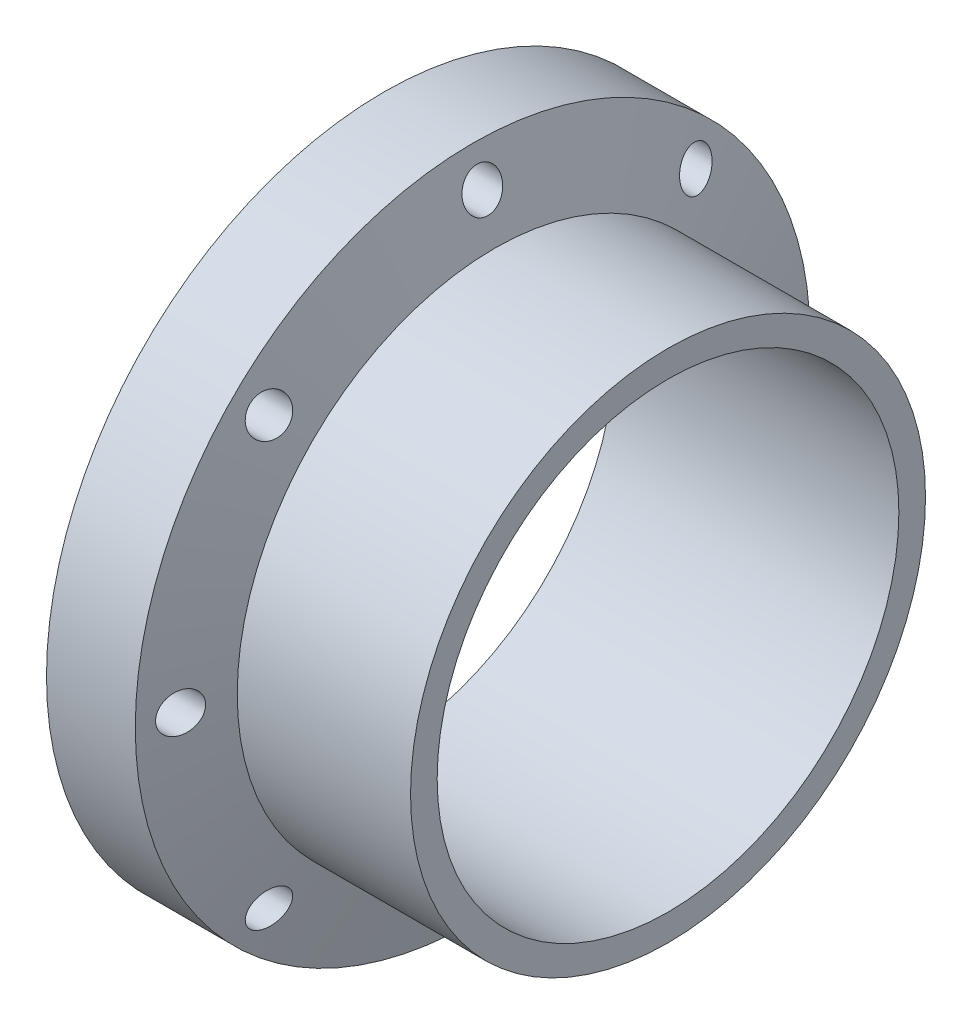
ISO-10303-21;
HEADER;
FILE_DESCRIPTION(('STEP AP214'),'2;1');
FILE_NAME('part.step','',(''),(''),'','','');
FILE_SCHEMA(('AUTOMOTIVE_DESIGN { 1 0 10303 214 1 1 1 1 }'));
ENDSEC;
DATA;
#1=APPLICATION_CONTEXT('core data for automotive mechanical design processes');
#2=APPLICATION_PROTOCOL_DEFINITION('international standard','automotive_design',2000,#1);
#3=PRODUCT_CONTEXT('',#1,'mechanical');
#4=PRODUCT('Part','Part','',(#3));
#5=PRODUCT_RELATED_PRODUCT_CATEGORY('part','',(#4));
#6=PRODUCT_DEFINITION_FORMATION('','',#4);
#7=PRODUCT_DEFINITION_CONTEXT('part definition',#1,'design');
#8=PRODUCT_DEFINITION('design','',#6,#7);
#9=PRODUCT_DEFINITION_SHAPE('','',#8);
#10=(LENGTH_UNIT() NAMED_UNIT(*) SI_UNIT(.MILLI.,.METRE.));
#11=(NAMED_UNIT(*) PLANE_ANGLE_UNIT() SI_UNIT($,.RADIAN.));
#12=(NAMED_UNIT(*) SI_UNIT($,.STERADIAN.) SOLID_ANGLE_UNIT());
#13=UNCERTAINTY_MEASURE_WITH_UNIT(LENGTH_MEASURE(1.E-05),#10,'distance_accuracy_value','');
#14=(GEOMETRIC_REPRESENTATION_CONTEXT(3) GLOBAL_UNCERTAINTY_ASSIGNED_CONTEXT((#13)) GLOBAL_UNIT_ASSIGNED_CONTEXT((#10,
#11,#12)) REPRESENTATION_CONTEXT('',''));
#15=CARTESIAN_POINT('',(0.,0.,0.));
#16=DIRECTION('',(0.,0.,1.));
#17=DIRECTION('',(1.,0.,0.));
#18=AXIS2_PLACEMENT_3D('',#15,#16,#17);
#19=CARTESIAN_POINT('',(97.3274745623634,0.,0.));
#20=DIRECTION('',(-1.,0.,0.));
#21=DIRECTION('',(0.,0.,1.));
#22=AXIS2_PLACEMENT_3D('',#19,#20,#21);
#23=CONICAL_SURFACE('',#22,23.01875,1.30149741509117);
#24=CARTESIAN_POINT('',(95.8814063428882,-1.23497370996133,-28.2310620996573));
#25=CARTESIAN_POINT('',(95.8635554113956,-1.16677636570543,-28.2987834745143));
#26=CARTESIAN_POINT('',(95.8471859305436,-1.09276010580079,-28.3611175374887));
#27=CARTESIAN_POINT('',(95.8178682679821,-0.934963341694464,-28.4730370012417));
#28=CARTESIAN_POINT('',(95.8049229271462,-0.851174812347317,-28.5226118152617));
#29=CARTESIAN_POINT('',(95.7828263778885,-0.676061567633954,-28.6073804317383));
#30=CARTESIAN_POINT('',(95.773677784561,-0.584731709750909,-28.6425643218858));
#31=CARTESIAN_POINT('',(95.7594628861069,-0.397211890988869,-28.6972854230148));
#32=CARTESIAN_POINT('',(95.7543956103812,-0.301023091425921,-28.7168263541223));
#33=CARTESIAN_POINT('',(95.7485444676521,-0.108288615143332,-28.7393938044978));
#34=CARTESIAN_POINT('',(95.7476881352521,-0.0117777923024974,-28.7426997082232));
#35=CARTESIAN_POINT('',(95.7500879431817,0.180425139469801,-28.7334408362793));
#36=CARTESIAN_POINT('',(95.7533439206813,0.276117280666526,-28.7208766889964));
#37=CARTESIAN_POINT('',(95.7638299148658,0.463192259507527,-28.6804696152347));
#38=CARTESIAN_POINT('',(95.7710284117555,0.554603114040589,-28.6527478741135));
#39=CARTESIAN_POINT('',(95.7891720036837,0.731400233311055,-28.5830223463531));
#40=CARTESIAN_POINT('',(95.80011721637,0.816786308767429,-28.5410181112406));
#41=CARTESIAN_POINT('',(95.8256027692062,0.980248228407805,-28.4434827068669));
#42=CARTESIAN_POINT('',(95.8401842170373,1.05822533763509,-28.3877969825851));
#43=CARTESIAN_POINT('',(95.872478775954,1.20372872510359,-28.2648868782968));
#44=CARTESIAN_POINT('',(95.890192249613,1.27125379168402,-28.1976611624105));
#45=CARTESIAN_POINT('',(95.9288093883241,1.39591650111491,-28.0516818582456));
#46=CARTESIAN_POINT('',(95.9497864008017,1.45272366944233,-27.9726655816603));
#47=CARTESIAN_POINT('',(95.9940147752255,1.55231369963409,-27.8068225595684));
#48=CARTESIAN_POINT('',(96.0172665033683,1.59509429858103,-27.7199945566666));
#49=CARTESIAN_POINT('',(96.0662487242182,1.66686977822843,-27.5379813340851));
#50=CARTESIAN_POINT('',(96.0920353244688,1.69536959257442,-27.4426159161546));
#51=CARTESIAN_POINT('',(96.1447406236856,1.73584855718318,-27.2487422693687));
#52=CARTESIAN_POINT('',(96.1716594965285,1.74782516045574,-27.1502335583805));
#53=CARTESIAN_POINT('',(96.2266350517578,1.75513217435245,-26.9501594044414));
#54=CARTESIAN_POINT('',(96.2547031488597,1.75002360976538,-26.8485808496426));
#55=CARTESIAN_POINT('',(96.3105161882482,1.72233687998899,-26.6477337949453));
#56=CARTESIAN_POINT('',(96.338261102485,1.69975720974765,-26.548465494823));
#57=CARTESIAN_POINT('',(96.3928256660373,1.63742146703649,-26.3543096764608));
#58=CARTESIAN_POINT('',(96.4196367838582,1.59753744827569,-26.259460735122));
#59=CARTESIAN_POINT('',(96.4712626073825,1.50151743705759,-26.0777707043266));
#60=CARTESIAN_POINT('',(96.4960774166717,1.44538228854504,-25.9909291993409));
#61=CARTESIAN_POINT('',(96.5424587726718,1.31933775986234,-25.8293659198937));
#62=CARTESIAN_POINT('',(96.564073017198,1.24967647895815,-25.7544645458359));
#63=CARTESIAN_POINT('',(96.6037440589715,1.09781868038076,-25.6175192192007));
#64=CARTESIAN_POINT('',(96.62180159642,1.01562477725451,-25.5554725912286));
#65=CARTESIAN_POINT('',(96.6530532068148,0.844186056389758,-25.4484090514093));
#66=CARTESIAN_POINT('',(96.6663990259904,0.755301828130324,-25.4028592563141));
#67=CARTESIAN_POINT('',(96.6885533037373,0.570602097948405,-25.3273902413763));
#68=CARTESIAN_POINT('',(96.6973629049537,0.474788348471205,-25.2974670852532));
#69=CARTESIAN_POINT('',(96.7098189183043,0.28286658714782,-25.2551945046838));
#70=CARTESIAN_POINT('',(96.7136483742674,0.18690737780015,-25.2422219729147));
#71=CARTESIAN_POINT('',(96.7165901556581,-0.00590365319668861,-25.2322545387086));
#72=CARTESIAN_POINT('',(96.7157031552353,-0.102755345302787,-25.2352573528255));
#73=CARTESIAN_POINT('',(96.709314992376,-0.29260266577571,-25.2569101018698));
#74=CARTESIAN_POINT('',(96.7039044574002,-0.385636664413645,-25.2752527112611));
#75=CARTESIAN_POINT('',(96.6888069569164,-0.567214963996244,-25.32654394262));
#76=CARTESIAN_POINT('',(96.6791199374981,-0.655759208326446,-25.3594927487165));
#77=CARTESIAN_POINT('',(96.655741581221,-0.82673417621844,-25.4392451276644));
#78=CARTESIAN_POINT('',(96.6420163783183,-0.909105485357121,-25.4861659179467));
#79=CARTESIAN_POINT('',(96.6110959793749,-1.06479911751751,-25.5922623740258));
#80=CARTESIAN_POINT('',(96.5939003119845,-1.13812020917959,-25.6514397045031));
#81=CARTESIAN_POINT('',(96.5560297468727,-1.27612493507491,-25.7823290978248));
#82=CARTESIAN_POINT('',(96.5352625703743,-1.34046514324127,-25.8543763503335));
#83=CARTESIAN_POINT('',(96.4913261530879,-1.45620539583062,-26.007554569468));
#84=CARTESIAN_POINT('',(96.4681564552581,-1.5076029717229,-26.0886872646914));
#85=CARTESIAN_POINT('',(96.4191750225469,-1.59805827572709,-26.2611023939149));
#86=CARTESIAN_POINT('',(96.3932958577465,-1.63656369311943,-26.3526555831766));
#87=CARTESIAN_POINT('',(96.3404521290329,-1.69755791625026,-26.5406512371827));
#88=CARTESIAN_POINT('',(96.3134874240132,-1.72004463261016,-26.6370943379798));
#89=CARTESIAN_POINT('',(96.2584470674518,-1.74890070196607,-26.835060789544));
#90=CARTESIAN_POINT('',(96.2303615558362,-1.75479659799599,-26.9366506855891));
#91=CARTESIAN_POINT('',(96.17460393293,-1.74894446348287,-27.1394710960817));
#92=CARTESIAN_POINT('',(96.1469319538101,-1.73719090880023,-27.2407014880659));
#93=CARTESIAN_POINT('',(96.0925764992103,-1.69611027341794,-27.4406062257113));
#94=CARTESIAN_POINT('',(96.0659013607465,-1.66665997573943,-27.5392575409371));
#95=CARTESIAN_POINT('',(96.0145132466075,-1.59074721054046,-27.7302406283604));
#96=CARTESIAN_POINT('',(95.9897978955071,-1.54430573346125,-27.8225800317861));
#97=CARTESIAN_POINT('',(95.9509663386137,-1.4540702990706,-27.9682893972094));
#98=CARTESIAN_POINT('',(95.9360979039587,-1.41471859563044,-28.0242560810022));
#99=CARTESIAN_POINT('',(95.9077024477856,-1.32956149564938,-28.1314212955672));
#100=CARTESIAN_POINT('',(95.8941753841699,-1.28375630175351,-28.1826199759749));
#101=CARTESIAN_POINT('',(95.8814063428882,-1.23497370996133,-28.2310620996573));
#102=B_SPLINE_CURVE_WITH_KNOTS('',3,(#24,#25,#26,#27,#28,#29,#30,#31,#32,#33,#34,#35,#36,#37,
#38,#39,#40,#41,#42,#43,#44,#45,#46,#47,#48,#49,#50,#51,#52,#53,#54,#55,#56,#57,#58,#59,#60,#61,
#62,#63,#64,#65,#66,#67,#68,#69,#70,#71,#72,#73,#74,#75,#76,#77,#78,#79,#80,#81,#82,#83,#84,#85,
#86,#87,#88,#89,#90,#91,#92,#93,#94,#95,#96,#97,#98,#99,#100,#101),.UNSPECIFIED.,.T.,.F.,(4,2,2,
2,2,2,2,2,2,2,2,2,2,2,2,2,2,2,2,2,2,2,2,2,2,2,2,2,2,2,2,2,2,2,2,2,2,2,4),(0.,0.293014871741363,
0.586272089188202,0.87973096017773,1.17312002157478,1.46144209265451,1.74975274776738,
2.03579135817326,2.32183895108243,2.61127984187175,2.90075426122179,3.19806074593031,
3.49541517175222,3.80246669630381,4.1095655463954,4.42461478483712,4.73969116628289,
5.05713798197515,5.37456831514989,5.68664862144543,5.99866391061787,6.29944103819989,
6.60014236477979,6.8894462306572,7.17870874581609,7.46231110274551,7.74591703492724,
8.03197272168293,8.3180672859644,8.61314345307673,8.90827585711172,9.21478973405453,
9.52134358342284,9.83656102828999,10.1518771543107,10.4694145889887,10.7865610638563,
10.9961656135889,11.2057635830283),.UNSPECIFIED.);
#103=CARTESIAN_POINT('',(95.8814063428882,-1.23497370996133,-28.2310620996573));
#104=VERTEX_POINT('',#103);
#105=EDGE_CURVE('E160',#104,#104,#102,.T.);
#106=ORIENTED_EDGE('',*,*,#105,.F.);
#107=EDGE_LOOP('',(#106));
#108=FACE_BOUND('',#107,.T.);
#109=CARTESIAN_POINT('',(95.7483627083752,-20.3223202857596,-20.3223202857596));
#110=CARTESIAN_POINT('',(95.7483640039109,-20.2543795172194,-20.3902548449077));
#111=CARTESIAN_POINT('',(95.75041702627,-20.1807851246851,-20.4526376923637));
#112=CARTESIAN_POINT('',(95.7585781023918,-20.0244581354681,-20.5644638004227));
#113=CARTESIAN_POINT('',(95.7646911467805,-19.9417143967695,-20.6138910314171));
#114=CARTESIAN_POINT('',(95.7807868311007,-19.7696589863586,-20.6983891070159));
#115=CARTESIAN_POINT('',(95.7907651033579,-19.6803548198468,-20.7334760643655));
#116=CARTESIAN_POINT('',(95.8143065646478,-19.4976938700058,-20.7885569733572));
#117=CARTESIAN_POINT('',(95.827869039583,-19.4043378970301,-20.8085539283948));
#118=CARTESIAN_POINT('',(95.8584155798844,-19.2148770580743,-20.8333229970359));
#119=CARTESIAN_POINT('',(95.8754431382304,-19.1187521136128,-20.8378871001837));
#120=CARTESIAN_POINT('',(95.9123500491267,-18.9275908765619,-20.831355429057));
#121=CARTESIAN_POINT('',(95.9322298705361,-18.8325547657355,-20.8202570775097));
#122=CARTESIAN_POINT('',(95.9749770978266,-18.6432003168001,-20.7823813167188));
#123=CARTESIAN_POINT('',(95.9979169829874,-18.5489917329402,-20.7551372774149));
#124=CARTESIAN_POINT('',(96.0456941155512,-18.3668248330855,-20.6855881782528));
#125=CARTESIAN_POINT('',(96.0705316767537,-18.2788675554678,-20.6432806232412));
#126=CARTESIAN_POINT('',(96.1222871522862,-18.1087795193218,-20.543334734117));
#127=CARTESIAN_POINT('',(96.1492460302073,-18.0269212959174,-20.4852535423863));
#128=CARTESIAN_POINT('',(96.2038054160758,-17.8743961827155,-20.3561366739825));
#129=CARTESIAN_POINT('',(96.2314060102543,-17.8037308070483,-20.2850992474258));
#130=CARTESIAN_POINT('',(96.2870735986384,-17.6741715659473,-20.1304528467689));
#131=CARTESIAN_POINT('',(96.3151386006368,-17.6155477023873,-20.046616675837));
#132=CARTESIAN_POINT('',(96.3703546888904,-17.5136409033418,-19.869804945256));
#133=CARTESIAN_POINT('',(96.3975057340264,-17.4703586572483,-19.77682897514));
#134=CARTESIAN_POINT('',(96.4500286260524,-17.400577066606,-19.5844143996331));
#135=CARTESIAN_POINT('',(96.4754023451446,-17.3740598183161,-19.48498281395));
#136=CARTESIAN_POINT('',(96.5235519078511,-17.3387874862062,-19.2823977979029));
#137=CARTESIAN_POINT('',(96.5463280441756,-17.3300303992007,-19.1792447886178));
#138=CARTESIAN_POINT('',(96.5879152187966,-17.3308775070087,-18.9749005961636));
#139=CARTESIAN_POINT('',(96.6068113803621,-17.3400266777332,-18.8737250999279));
#140=CARTESIAN_POINT('',(96.640604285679,-17.3758657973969,-18.6738374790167));
#141=CARTESIAN_POINT('',(96.655502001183,-17.4025514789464,-18.5751247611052));
#142=CARTESIAN_POINT('',(96.6801763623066,-17.4715573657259,-18.3870897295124));
#143=CARTESIAN_POINT('',(96.690130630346,-17.5132247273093,-18.2975510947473));
#144=CARTESIAN_POINT('',(96.7053475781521,-17.6112221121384,-18.1264573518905));
#145=CARTESIAN_POINT('',(96.7106113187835,-17.6675488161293,-18.0449004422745));
#146=CARTESIAN_POINT('',(96.7161243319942,-17.7911336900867,-17.8948928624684));
#147=CARTESIAN_POINT('',(96.7165348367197,-17.8579651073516,-17.8260960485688));
#148=CARTESIAN_POINT('',(96.7127419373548,-18.0018663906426,-17.7003702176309));
#149=CARTESIAN_POINT('',(96.7085389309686,-18.0789353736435,-17.6434401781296));
#150=CARTESIAN_POINT('',(96.6957567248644,-18.2402408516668,-17.5434969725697));
#151=CARTESIAN_POINT('',(96.687220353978,-18.3244006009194,-17.500354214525));
#152=CARTESIAN_POINT('',(96.6661291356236,-18.4981133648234,-17.4282608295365));
#153=CARTESIAN_POINT('',(96.6535740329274,-18.5876667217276,-17.399311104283));
#154=CARTESIAN_POINT('',(96.6246442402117,-18.7713536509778,-17.355755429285));
#155=CARTESIAN_POINT('',(96.608204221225,-18.8655409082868,-17.341419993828));
#156=CARTESIAN_POINT('',(96.5722109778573,-19.0543980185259,-17.3281220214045));
#157=CARTESIAN_POINT('',(96.5526572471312,-19.149067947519,-17.3291619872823));
#158=CARTESIAN_POINT('',(96.5103111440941,-19.3398522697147,-17.3466230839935));
#159=CARTESIAN_POINT('',(96.4874274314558,-19.4358957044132,-17.3635973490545));
#160=CARTESIAN_POINT('',(96.4397054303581,-19.6234082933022,-17.4130084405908));
#161=CARTESIAN_POINT('',(96.4148667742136,-19.7148765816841,-17.4454481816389));
#162=CARTESIAN_POINT('',(96.3630119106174,-19.8941844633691,-17.52622807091));
#163=CARTESIAN_POINT('',(96.3359492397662,-19.9817676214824,-17.5751081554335));
#164=CARTESIAN_POINT('',(96.2812662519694,-20.1472365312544,-17.6869505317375));
#165=CARTESIAN_POINT('',(96.2536458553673,-20.2251208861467,-17.7499148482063));
#166=CARTESIAN_POINT('',(96.198012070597,-20.3706382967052,-17.8896875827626));
#167=CARTESIAN_POINT('',(96.1700028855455,-20.4380169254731,-17.9667629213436));
#168=CARTESIAN_POINT('',(96.1149654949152,-20.5584933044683,-18.1316844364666));
#169=CARTESIAN_POINT('',(96.0879373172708,-20.6115906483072,-18.2195309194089));
#170=CARTESIAN_POINT('',(96.0356675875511,-20.7017124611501,-18.4033572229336));
#171=CARTESIAN_POINT('',(96.0104222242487,-20.7387721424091,-18.4993186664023));
#172=CARTESIAN_POINT('',(95.9623661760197,-20.7956393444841,-18.6968072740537));
#173=CARTESIAN_POINT('',(95.9395551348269,-20.815449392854,-18.7983336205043));
#174=CARTESIAN_POINT('',(95.8975324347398,-20.8366545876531,-19.0015186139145));
#175=CARTESIAN_POINT('',(95.8782489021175,-20.8384707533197,-19.1031183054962));
#176=CARTESIAN_POINT('',(95.8431991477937,-20.8244010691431,-19.3057325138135));
#177=CARTESIAN_POINT('',(95.8274331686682,-20.8085139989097,-19.4067469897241));
#178=CARTESIAN_POINT('',(95.8003594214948,-20.7600473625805,-19.6017287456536));
#179=CARTESIAN_POINT('',(95.7889226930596,-20.7280308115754,-19.6958184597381));
#180=CARTESIAN_POINT('',(95.7701536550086,-20.6483830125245,-19.8774795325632));
#181=CARTESIAN_POINT('',(95.7628153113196,-20.6007748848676,-19.9650603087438));
#182=CARTESIAN_POINT('',(95.754552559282,-20.5135582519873,-20.0973109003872));
#183=CARTESIAN_POINT('',(95.7522339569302,-20.4785333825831,-20.14498085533));
#184=CARTESIAN_POINT('',(95.7491386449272,-20.4038265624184,-20.2365752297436));
#185=CARTESIAN_POINT('',(95.7483619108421,-20.364144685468,-20.2804997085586));
#186=CARTESIAN_POINT('',(95.7483627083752,-20.3223202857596,-20.3223202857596));
#187=B_SPLINE_CURVE_WITH_KNOTS('',3,(#109,#110,#111,#112,#113,#114,#115,#116,#117,#118,#119,
#120,#121,#122,#123,#124,#125,#126,#127,#128,#129,#130,#131,#132,#133,#134,#135,#136,#137,#138,
#139,#140,#141,#142,#143,#144,#145,#146,#147,#148,#149,#150,#151,#152,#153,#154,#155,#156,#157,
#158,#159,#160,#161,#162,#163,#164,#165,#166,#167,#168,#169,#170,#171,#172,#173,#174,#175,#176,
#177,#178,#179,#180,#181,#182,#183,#184,#185,#186),.UNSPECIFIED.,.T.,.F.,(4,2,2,2,2,2,2,2,2,2,2,
2,2,2,2,2,2,2,2,2,2,2,2,2,2,2,2,2,2,2,2,2,2,2,2,2,2,2,4),(0.,0.288015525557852,
0.576385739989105,0.864431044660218,1.15241900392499,1.44427343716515,1.73617590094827,
2.03695693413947,2.33778781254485,2.64814043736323,2.95853500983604,3.27527126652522,
3.59202175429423,3.90843340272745,4.22480936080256,4.53325005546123,4.84161572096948,
5.13791147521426,5.43414019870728,5.72049896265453,6.00683304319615,6.29039069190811,
6.57396635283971,6.86270066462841,7.15148197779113,7.45067375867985,7.74992194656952,
8.06015440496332,8.37043148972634,8.68733436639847,9.00424625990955,9.32045876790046,
9.63662493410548,9.94537549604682,10.2541473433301,10.5528191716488,10.8510500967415,
11.0283555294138,11.2056581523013),.UNSPECIFIED.);
#188=CARTESIAN_POINT('',(95.7483627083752,-20.3223202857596,-20.3223202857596));
#189=VERTEX_POINT('',#188);
#190=EDGE_CURVE('E142',#189,#189,#187,.T.);
#191=ORIENTED_EDGE('',*,*,#190,.F.);
#192=EDGE_LOOP('',(#191));
#193=FACE_BOUND('',#192,.T.);
#194=CARTESIAN_POINT('',(95.8814063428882,-28.2310620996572,-1.2349737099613));
#195=CARTESIAN_POINT('',(95.9001172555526,-28.160078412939,-1.30644390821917));
#196=CARTESIAN_POINT('',(95.9204839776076,-28.0830692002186,-1.37162621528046));
#197=CARTESIAN_POINT('',(95.9639434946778,-27.9194812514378,-1.48765101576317));
#198=CARTESIAN_POINT('',(95.9870406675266,-27.8328871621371,-1.53847002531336));
#199=CARTESIAN_POINT('',(96.03527214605,-27.65295540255,-1.62440553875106));
#200=CARTESIAN_POINT('',(96.0604027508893,-27.5596300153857,-1.6595498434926));
#201=CARTESIAN_POINT('',(96.1120649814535,-27.3687854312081,-1.71349418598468));
#202=CARTESIAN_POINT('',(96.1385962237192,-27.2712673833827,-1.7322986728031));
#203=CARTESIAN_POINT('',(96.1929702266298,-27.0725015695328,-1.75344960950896));
#204=CARTESIAN_POINT('',(96.2208289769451,-26.9712188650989,-1.75542751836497));
#205=CARTESIAN_POINT('',(96.2765440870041,-26.7698048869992,-1.74195466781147));
#206=CARTESIAN_POINT('',(96.3044004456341,-26.669673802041,-1.72650109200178));
#207=CARTESIAN_POINT('',(96.3596542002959,-26.4721632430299,-1.67824089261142));
#208=CARTESIAN_POINT('',(96.3870420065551,-26.3748315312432,-1.64522719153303));
#209=CARTESIAN_POINT('',(96.4401661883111,-26.1870453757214,-1.56249944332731));
#210=CARTESIAN_POINT('',(96.4659026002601,-26.0965907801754,-1.51278576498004));
#211=CARTESIAN_POINT('',(96.5145754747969,-25.9263569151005,-1.39855762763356));
#212=CARTESIAN_POINT('',(96.5375416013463,-25.8464634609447,-1.33422625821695));
#213=CARTESIAN_POINT('',(96.5802006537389,-25.6986840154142,-1.19208404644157));
#214=CARTESIAN_POINT('',(96.5998941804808,-25.6307958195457,-1.11427568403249));
#215=CARTESIAN_POINT('',(96.634644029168,-25.5114072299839,-0.950112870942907));
#216=CARTESIAN_POINT('',(96.6498325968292,-25.459437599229,-0.864127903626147));
#217=CARTESIAN_POINT('',(96.6758069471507,-25.3707703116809,-0.684003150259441));
#218=CARTESIAN_POINT('',(96.6865938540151,-25.3340687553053,-0.589865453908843));
#219=CARTESIAN_POINT('',(96.7029679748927,-25.2784292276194,-0.400095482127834));
#220=CARTESIAN_POINT('',(96.7087427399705,-25.2588502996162,-0.304667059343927));
#221=CARTESIAN_POINT('',(96.715551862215,-25.2357696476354,-0.111724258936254));
#222=CARTESIAN_POINT('',(96.7165870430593,-25.2322651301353,-0.0142102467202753));
#223=CARTESIAN_POINT('',(96.7139076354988,-25.2413435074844,0.177584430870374));
#224=CARTESIAN_POINT('',(96.7103091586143,-25.2535331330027,0.271885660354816));
#225=CARTESIAN_POINT('',(96.6987103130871,-25.2928922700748,0.457019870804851));
#226=CARTESIAN_POINT('',(96.690710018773,-25.3200615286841,0.547852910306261));
#227=CARTESIAN_POINT('',(96.6705946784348,-25.3885535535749,0.723821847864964));
#228=CARTESIAN_POINT('',(96.6584678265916,-25.4299169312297,0.808940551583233));
#229=CARTESIAN_POINT('',(96.6305581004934,-25.5254392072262,0.970997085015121));
#230=CARTESIAN_POINT('',(96.6147748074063,-25.579599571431,1.04793397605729));
#231=CARTESIAN_POINT('',(96.579613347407,-25.7007463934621,1.19377818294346));
#232=CARTESIAN_POINT('',(96.5601473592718,-25.7680478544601,1.2624024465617));
#233=CARTESIAN_POINT('',(96.5185762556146,-25.9124526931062,1.38744647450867));
#234=CARTESIAN_POINT('',(96.4964706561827,-25.9895578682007,1.44386399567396));
#235=CARTESIAN_POINT('',(96.4493994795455,-26.1545791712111,1.54517951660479));
#236=CARTESIAN_POINT('',(96.4243564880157,-26.2427975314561,1.58954941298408));
#237=CARTESIAN_POINT('',(96.3728982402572,-26.4250694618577,1.66280824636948));
#238=CARTESIAN_POINT('',(96.346482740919,-26.5191240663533,1.69169443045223));
#239=CARTESIAN_POINT('',(96.2921675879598,-26.7135998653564,1.73401173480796));
#240=CARTESIAN_POINT('',(96.2642474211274,-26.8141283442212,1.74692483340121));
#241=CARTESIAN_POINT('',(96.2085132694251,-27.0159444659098,1.75527778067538));
#242=CARTESIAN_POINT('',(96.1806992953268,-27.1172321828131,1.75071590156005));
#243=CARTESIAN_POINT('',(96.1256205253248,-27.3189006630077,1.7240193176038));
#244=CARTESIAN_POINT('',(96.0983656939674,-27.4192576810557,1.70168356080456));
#245=CARTESIAN_POINT('',(96.0454977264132,-27.6149240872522,1.63965764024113));
#246=CARTESIAN_POINT('',(96.0198845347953,-27.7102336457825,1.59996806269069));
#247=CARTESIAN_POINT('',(95.9713259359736,-27.8917571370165,1.50475892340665));
#248=CARTESIAN_POINT('',(95.9483514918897,-27.978068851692,1.449440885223));
#249=CARTESIAN_POINT('',(95.9053695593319,-28.14017955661,1.32416927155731));
#250=CARTESIAN_POINT('',(95.8853616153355,-28.2159801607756,1.25421794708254));
#251=CARTESIAN_POINT('',(95.8494476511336,-28.3524764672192,1.10383608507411));
#252=CARTESIAN_POINT('',(95.8334384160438,-28.4135504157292,1.02377366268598));
#253=CARTESIAN_POINT('',(95.8052557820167,-28.5213177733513,0.853886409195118));
#254=CARTESIAN_POINT('',(95.7930816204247,-28.5680140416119,0.764063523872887));
#255=CARTESIAN_POINT('',(95.7732775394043,-28.6440927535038,0.580398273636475));
#256=CARTESIAN_POINT('',(95.7655111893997,-28.6739946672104,0.486785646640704));
#257=CARTESIAN_POINT('',(95.7541513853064,-28.7177621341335,0.295646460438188));
#258=CARTESIAN_POINT('',(95.7505571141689,-28.7316308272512,0.198120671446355));
#259=CARTESIAN_POINT('',(95.747683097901,-28.7427190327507,0.00432077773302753));
#260=CARTESIAN_POINT('',(95.7483061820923,-28.7403135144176,-0.091930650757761));
#261=CARTESIAN_POINT('',(95.7536209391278,-28.719813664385,-0.282656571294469));
#262=CARTESIAN_POINT('',(95.7583134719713,-28.7017160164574,-0.377130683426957));
#263=CARTESIAN_POINT('',(95.7716028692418,-28.6505472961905,-0.561229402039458));
#264=CARTESIAN_POINT('',(95.7801845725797,-28.6175343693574,-0.650871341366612));
#265=CARTESIAN_POINT('',(95.8009995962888,-28.5376489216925,-0.823191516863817));
#266=CARTESIAN_POINT('',(95.8132285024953,-28.4907931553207,-0.905878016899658));
#267=CARTESIAN_POINT('',(95.8351062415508,-28.4072175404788,-1.02906886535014));
#268=CARTESIAN_POINT('',(95.8436567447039,-28.3746001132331,-1.07261554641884));
#269=CARTESIAN_POINT('',(95.8617810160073,-28.3055887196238,-1.15637086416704));
#270=CARTESIAN_POINT('',(95.8713547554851,-28.2691948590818,-1.19657959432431));
#271=CARTESIAN_POINT('',(95.8814063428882,-28.2310620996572,-1.2349737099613));
#272=B_SPLINE_CURVE_WITH_KNOTS('',3,(#194,#195,#196,#197,#198,#199,#200,#201,#202,#203,#204,
#205,#206,#207,#208,#209,#210,#211,#212,#213,#214,#215,#216,#217,#218,#219,#220,#221,#222,#223,
#224,#225,#226,#227,#228,#229,#230,#231,#232,#233,#234,#235,#236,#237,#238,#239,#240,#241,#242,
#243,#244,#245,#246,#247,#248,#249,#250,#251,#252,#253,#254,#255,#256,#257,#258,#259,#260,#261,
#262,#263,#264,#265,#266,#267,#268,#269,#270,#271),.UNSPECIFIED.,.T.,.F.,(4,2,2,2,2,2,2,2,2,2,2,
2,2,2,2,2,2,2,2,2,2,2,2,2,2,2,2,2,2,2,2,2,2,2,2,2,2,2,4),(0.,0.307152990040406,
0.614805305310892,0.921909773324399,1.22893059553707,1.54265902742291,1.85643815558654,
2.17400233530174,2.49155950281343,2.80533932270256,3.11906146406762,3.42236826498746,
3.72559755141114,4.01691944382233,4.30819070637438,4.59230328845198,4.87641107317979,
5.16133860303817,5.44629878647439,5.73918943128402,6.03213385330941,6.33637467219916,
6.64066956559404,6.95459421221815,7.26854989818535,7.58610830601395,7.9036559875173,
8.21728252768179,8.53086085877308,8.83522937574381,9.13953732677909,9.4338252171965,
9.72805546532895,10.0155299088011,10.3030651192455,10.5894889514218,10.8755675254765,
11.0405761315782,11.205580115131),.UNSPECIFIED.);
#273=CARTESIAN_POINT('',(95.8814063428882,-28.2310620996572,-1.2349737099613));
#274=VERTEX_POINT('',#273);
#275=EDGE_CURVE('E134',#274,#274,#272,.T.);
#276=ORIENTED_EDGE('',*,*,#275,.F.);
#277=EDGE_LOOP('',(#276));
#278=FACE_BOUND('',#277,.T.);
#279=CARTESIAN_POINT('',(96.1903731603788,-20.3874358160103,17.9125018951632));
#280=CARTESIAN_POINT('',(96.2182602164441,-20.3194736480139,17.8367746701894));
#281=CARTESIAN_POINT('',(96.2464368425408,-20.2449013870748,17.7669740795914));
#282=CARTESIAN_POINT('',(96.3025663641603,-20.0846593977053,17.6412502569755));
#283=CARTESIAN_POINT('',(96.3305189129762,-19.9989750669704,17.5853455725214));
#284=CARTESIAN_POINT('',(96.385360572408,-19.8189188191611,17.489146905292));
#285=CARTESIAN_POINT('',(96.412249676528,-19.7245468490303,17.4488530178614));
#286=CARTESIAN_POINT('',(96.4641126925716,-19.5297702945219,17.3852412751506));
#287=CARTESIAN_POINT('',(96.4890872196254,-19.429367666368,17.361917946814));
#288=CARTESIAN_POINT('',(96.5359727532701,-19.2267112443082,17.3333870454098));
#289=CARTESIAN_POINT('',(96.557919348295,-19.1244984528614,17.3279480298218));
#290=CARTESIAN_POINT('',(96.598322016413,-18.9199937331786,17.3350502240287));
#291=CARTESIAN_POINT('',(96.616778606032,-18.8177018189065,17.3475887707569));
#292=CARTESIAN_POINT('',(96.6488771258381,-18.6198250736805,17.3898501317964));
#293=CARTESIAN_POINT('',(96.6626663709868,-18.5241310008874,17.418948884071));
#294=CARTESIAN_POINT('',(96.685736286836,-18.338633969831,17.4932535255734));
#295=CARTESIAN_POINT('',(96.6950181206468,-18.2488294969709,17.5384552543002));
#296=CARTESIAN_POINT('',(96.708406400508,-18.0812836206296,17.6417270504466));
#297=CARTESIAN_POINT('',(96.7126974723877,-18.0032119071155,17.6992378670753));
#298=CARTESIAN_POINT('',(96.7165545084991,-17.8575579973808,17.8264088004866));
#299=CARTESIAN_POINT('',(96.716121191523,-17.7899742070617,17.8960670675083));
#300=CARTESIAN_POINT('',(96.710607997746,-17.6685720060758,18.0438934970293));
#301=CARTESIAN_POINT('',(96.7056249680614,-17.6144964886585,18.1218544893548));
#302=CARTESIAN_POINT('',(96.691351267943,-17.5197439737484,18.2851648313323));
#303=CARTESIAN_POINT('',(96.6820605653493,-17.4790670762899,18.3705142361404));
#304=CARTESIAN_POINT('',(96.6594491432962,-17.4118107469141,18.5468059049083));
#305=CARTESIAN_POINT('',(96.6460995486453,-17.3853362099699,18.6377843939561));
#306=CARTESIAN_POINT('',(96.6158851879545,-17.3473999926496,18.8222453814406));
#307=CARTESIAN_POINT('',(96.5990199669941,-17.3359402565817,18.9157282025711));
#308=CARTESIAN_POINT('',(96.561781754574,-17.3279372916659,19.1056069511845));
#309=CARTESIAN_POINT('',(96.5413172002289,-17.3318613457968,19.2020044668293));
#310=CARTESIAN_POINT('',(96.4979287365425,-17.3552843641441,19.3923176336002));
#311=CARTESIAN_POINT('',(96.4750043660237,-17.374786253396,19.4862328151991));
#312=CARTESIAN_POINT('',(96.4264594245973,-17.4296716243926,19.672770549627));
#313=CARTESIAN_POINT('',(96.4007689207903,-17.4656393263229,19.7652031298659));
#314=CARTESIAN_POINT('',(96.3482328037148,-17.5524337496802,19.9424514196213));
#315=CARTESIAN_POINT('',(96.3213869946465,-17.6032629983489,20.0272658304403));
#316=CARTESIAN_POINT('',(96.2664908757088,-17.7200344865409,20.1894260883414));
#317=CARTESIAN_POINT('',(96.2384282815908,-17.7863745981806,20.2664816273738));
#318=CARTESIAN_POINT('',(96.1826489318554,-17.9314305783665,20.4080597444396));
#319=CARTESIAN_POINT('',(96.1549322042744,-18.0101474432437,20.4725813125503));
#320=CARTESIAN_POINT('',(96.1003906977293,-18.1784653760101,20.5876422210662));
#321=CARTESIAN_POINT('',(96.0735744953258,-18.2681460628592,20.6380693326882));
#322=CARTESIAN_POINT('',(96.0218099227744,-18.4553956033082,20.7226217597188));
#323=CARTESIAN_POINT('',(95.9968614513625,-18.5529640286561,20.7567479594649));
#324=CARTESIAN_POINT('',(95.9499147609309,-18.7516039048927,20.8070179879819));
#325=CARTESIAN_POINT('',(95.9278764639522,-18.8525965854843,20.823435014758));
#326=CARTESIAN_POINT('',(95.8869354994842,-19.0565303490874,20.8384220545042));
#327=CARTESIAN_POINT('',(95.8680323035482,-19.1594711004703,20.8369950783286));
#328=CARTESIAN_POINT('',(95.8344590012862,-19.3609541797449,20.8163391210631));
#329=CARTESIAN_POINT('',(95.8196761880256,-19.4595341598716,20.7976613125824));
#330=CARTESIAN_POINT('',(95.7940324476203,-19.6525254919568,20.7435665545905));
#331=CARTESIAN_POINT('',(95.7831707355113,-19.7469376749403,20.7081529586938));
#332=CARTESIAN_POINT('',(95.7659868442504,-19.9256781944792,20.622870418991));
#333=CARTESIAN_POINT('',(95.7595297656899,-20.0102333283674,20.57350360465));
#334=CARTESIAN_POINT('',(95.7507972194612,-20.1700842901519,20.4612619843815));
#335=CARTESIAN_POINT('',(95.7485211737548,-20.2453813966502,20.3983890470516));
#336=CARTESIAN_POINT('',(95.7482219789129,-20.383027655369,20.2623754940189));
#337=CARTESIAN_POINT('',(95.7501131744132,-20.445609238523,20.189470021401));
#338=CARTESIAN_POINT('',(95.7579175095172,-20.557953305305,20.0345709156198));
#339=CARTESIAN_POINT('',(95.7638305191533,-20.6077162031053,19.9525775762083));
#340=CARTESIAN_POINT('',(95.7794975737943,-20.6930650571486,19.7819905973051));
#341=CARTESIAN_POINT('',(95.7892469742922,-20.7286680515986,19.6934050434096));
#342=CARTESIAN_POINT('',(95.8123127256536,-20.7849716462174,19.5120718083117));
#343=CARTESIAN_POINT('',(95.8256291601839,-20.8056718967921,19.4193240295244));
#344=CARTESIAN_POINT('',(95.8557337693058,-20.8320682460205,19.2305669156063));
#345=CARTESIAN_POINT('',(95.8725790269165,-20.8374933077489,19.1345289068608));
#346=CARTESIAN_POINT('',(95.9091481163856,-20.8326857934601,18.9433768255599));
#347=CARTESIAN_POINT('',(95.9288730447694,-20.8224472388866,18.8482631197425));
#348=CARTESIAN_POINT('',(95.9713350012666,-20.7862939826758,18.6586000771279));
#349=CARTESIAN_POINT('',(95.9941457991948,-20.759908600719,18.5641573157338));
#350=CARTESIAN_POINT('',(96.041678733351,-20.6920428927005,18.381467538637));
#351=CARTESIAN_POINT('',(96.0663989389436,-20.65057766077,18.2932144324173));
#352=CARTESIAN_POINT('',(96.1077828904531,-20.5716904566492,18.1560584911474));
#353=CARTESIAN_POINT('',(96.1240657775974,-20.5383905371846,18.1046211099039));
#354=CARTESIAN_POINT('',(96.1569886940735,-20.4666667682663,18.0055775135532));
#355=CARTESIAN_POINT('',(96.1736287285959,-20.4282428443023,17.9579713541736));
#356=CARTESIAN_POINT('',(96.1903731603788,-20.3874358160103,17.9125018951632));
#357=B_SPLINE_CURVE_WITH_KNOTS('',3,(#279,#280,#281,#282,#283,#284,#285,#286,#287,#288,#289,
#290,#291,#292,#293,#294,#295,#296,#297,#298,#299,#300,#301,#302,#303,#304,#305,#306,#307,#308,
#309,#310,#311,#312,#313,#314,#315,#316,#317,#318,#319,#320,#321,#322,#323,#324,#325,#326,#327,
#328,#329,#330,#331,#332,#333,#334,#335,#336,#337,#338,#339,#340,#341,#342,#343,#344,#345,#346,
#347,#348,#349,#350,#351,#352,#353,#354,#355,#356),.UNSPECIFIED.,.T.,.F.,(4,2,2,2,2,2,2,2,2,2,2,
2,2,2,2,2,2,2,2,2,2,2,2,2,2,2,2,2,2,2,2,2,2,2,2,2,2,2,4),(0.,0.316283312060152,
0.632986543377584,0.949691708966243,1.26629469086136,1.57878401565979,1.8912270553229,
2.1926091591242,2.49391345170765,2.78367617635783,3.07339481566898,3.35708661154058,
3.64078052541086,3.92654184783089,4.21234017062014,4.50688588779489,4.80148692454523,
5.10746463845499,5.41349441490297,5.72845803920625,6.04344703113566,6.36087700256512,
6.67828975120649,6.99073250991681,7.30312255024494,7.60586448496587,7.90854578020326,
8.20148165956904,8.4943770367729,8.78130836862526,9.06823042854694,9.35480619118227,
9.64138867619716,9.93302506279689,10.2247727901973,10.5254591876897,10.8258454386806,
11.0157510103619,11.2056593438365),.UNSPECIFIED.);
#358=CARTESIAN_POINT('',(96.1903731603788,-20.3874358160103,17.9125018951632));
#359=VERTEX_POINT('',#358);
#360=EDGE_CURVE('E115',#359,#359,#357,.T.);
#361=ORIENTED_EDGE('',*,*,#360,.F.);
#362=EDGE_LOOP('',(#361));
#363=FACE_BOUND('',#362,.T.);
#364=CARTESIAN_POINT('',(96.3355049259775,-1.69928154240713,26.5584906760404));
#365=CARTESIAN_POINT('',(96.3626625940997,-1.67478120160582,26.4614614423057));
#366=CARTESIAN_POINT('',(96.3894318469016,-1.64191212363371,26.3663622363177));
#367=CARTESIAN_POINT('',(96.4413893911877,-1.56015846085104,26.182744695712));
#368=CARTESIAN_POINT('',(96.4665759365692,-1.51125654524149,26.094233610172));
#369=CARTESIAN_POINT('',(96.5145619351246,-1.3985380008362,25.9264064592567));
#370=CARTESIAN_POINT('',(96.5373593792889,-1.33470896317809,25.8470981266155));
#371=CARTESIAN_POINT('',(96.5797294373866,-1.19377664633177,25.7003130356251));
#372=CARTESIAN_POINT('',(96.5993031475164,-1.11667789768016,25.6328322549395));
#373=CARTESIAN_POINT('',(96.6340197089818,-0.953427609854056,25.5135466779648));
#374=CARTESIAN_POINT('',(96.6492635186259,-0.867559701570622,25.4613835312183));
#375=CARTESIAN_POINT('',(96.6753552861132,-0.687629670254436,25.3723089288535));
#376=CARTESIAN_POINT('',(96.6862041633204,-0.593569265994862,25.3353942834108));
#377=CARTESIAN_POINT('',(96.7027044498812,-0.403900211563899,25.2793234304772));
#378=CARTESIAN_POINT('',(96.7085427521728,-0.308496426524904,25.259528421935));
#379=CARTESIAN_POINT('',(96.7154786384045,-0.11556395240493,25.2360176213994));
#380=CARTESIAN_POINT('',(96.7165770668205,-0.0180356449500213,25.2322989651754));
#381=CARTESIAN_POINT('',(96.7140198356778,0.173810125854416,25.2409633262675));
#382=CARTESIAN_POINT('',(96.7104810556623,0.268147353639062,25.2529504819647));
#383=CARTESIAN_POINT('',(96.6989977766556,0.453387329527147,25.2919161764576));
#384=CARTESIAN_POINT('',(96.6910533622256,0.544290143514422,25.3188944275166));
#385=CARTESIAN_POINT('',(96.6710460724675,0.720412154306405,25.3870146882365));
#386=CARTESIAN_POINT('',(96.6589721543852,0.805615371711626,25.4281946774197));
#387=CARTESIAN_POINT('',(96.6311624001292,0.967869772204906,25.5233672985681));
#388=CARTESIAN_POINT('',(96.6154261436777,1.04492001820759,25.5773614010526));
#389=CARTESIAN_POINT('',(96.580355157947,1.19100978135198,25.6981846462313));
#390=CARTESIAN_POINT('',(96.5609328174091,1.25976824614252,25.7653279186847));
#391=CARTESIAN_POINT('',(96.5194414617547,1.38510513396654,25.9094390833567));
#392=CARTESIAN_POINT('',(96.497371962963,1.441681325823,25.9864087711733));
#393=CARTESIAN_POINT('',(96.4503663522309,1.54334063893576,26.1511788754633));
#394=CARTESIAN_POINT('',(96.4253525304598,1.58789663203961,26.2392824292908));
#395=CARTESIAN_POINT('',(96.3739434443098,1.66154598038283,26.4213547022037));
#396=CARTESIAN_POINT('',(96.3475479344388,1.69063657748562,26.515324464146));
#397=CARTESIAN_POINT('',(96.2932611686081,1.73338567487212,26.7096700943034));
#398=CARTESIAN_POINT('',(96.265349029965,1.74652498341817,26.8101546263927));
#399=CARTESIAN_POINT('',(96.2096207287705,1.75533748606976,27.0119196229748));
#400=CARTESIAN_POINT('',(96.1818045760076,1.75100894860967,27.1132001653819));
#401=CARTESIAN_POINT('',(96.1267068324,1.72478171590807,27.3149086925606));
#402=CARTESIAN_POINT('',(96.0994352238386,1.70267922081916,27.415313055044));
#403=CARTESIAN_POINT('',(96.0465238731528,1.64111057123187,27.6111130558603));
#404=CARTESIAN_POINT('',(96.02088407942,1.60164496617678,27.7065088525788));
#405=CARTESIAN_POINT('',(95.9722597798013,1.50685845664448,27.8882550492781));
#406=CARTESIAN_POINT('',(95.9492466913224,1.45173689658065,27.9747016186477));
#407=CARTESIAN_POINT('',(95.9061800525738,1.32683221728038,28.1371139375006));
#408=CARTESIAN_POINT('',(95.8861260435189,1.25705137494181,28.2130813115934));
#409=CARTESIAN_POINT('',(95.8501137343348,1.1069680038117,28.3499388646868));
#410=CARTESIAN_POINT('',(95.8340526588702,1.02703360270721,28.4112055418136));
#411=CARTESIAN_POINT('',(95.8057624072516,0.85736566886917,28.5193767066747));
#412=CARTESIAN_POINT('',(95.7935324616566,0.76763410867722,28.566284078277));
#413=CARTESIAN_POINT('',(95.7736168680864,0.5841128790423,28.6427873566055));
#414=CARTESIAN_POINT('',(95.7657946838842,0.490554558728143,28.6729030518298));
#415=CARTESIAN_POINT('',(95.7543221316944,0.299481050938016,28.7171036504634));
#416=CARTESIAN_POINT('',(95.7506711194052,0.201966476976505,28.7311910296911));
#417=CARTESIAN_POINT('',(95.7476863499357,0.00814888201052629,28.7427064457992));
#418=CARTESIAN_POINT('',(95.7482554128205,-0.0881305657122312,28.7405094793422));
#419=CARTESIAN_POINT('',(95.7534638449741,-0.278920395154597,28.7204194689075));
#420=CARTESIAN_POINT('',(95.7581030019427,-0.373430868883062,28.7025272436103));
#421=CARTESIAN_POINT('',(95.7712857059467,-0.557586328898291,28.6517676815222));
#422=CARTESIAN_POINT('',(95.7798116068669,-0.647251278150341,28.6189680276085));
#423=CARTESIAN_POINT('',(95.8005206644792,-0.819737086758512,28.5394848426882));
#424=CARTESIAN_POINT('',(95.8127040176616,-0.902557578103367,28.4928005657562));
#425=CARTESIAN_POINT('',(95.8406039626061,-1.0603843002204,28.3862118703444));
#426=CARTESIAN_POINT('',(95.856370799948,-1.13525472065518,28.3261196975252));
#427=CARTESIAN_POINT('',(95.8909059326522,-1.27386121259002,28.1949728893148));
#428=CARTESIAN_POINT('',(95.9096744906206,-1.3375963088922,28.1239172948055));
#429=CARTESIAN_POINT('',(95.9503083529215,-1.45410159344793,27.9707188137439));
#430=CARTESIAN_POINT('',(95.9722470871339,-1.50650449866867,27.8883162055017));
#431=CARTESIAN_POINT('',(96.0182294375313,-1.59678288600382,27.7164182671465));
#432=CARTESIAN_POINT('',(96.0422738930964,-1.63465254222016,27.6269201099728));
#433=CARTESIAN_POINT('',(96.0926720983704,-1.69604512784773,27.4402750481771));
#434=CARTESIAN_POINT('',(96.119075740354,-1.71905638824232,27.342973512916));
#435=CARTESIAN_POINT('',(96.1727663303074,-1.74822744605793,27.1461955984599));
#436=CARTESIAN_POINT('',(96.2000523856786,-1.75440376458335,27.0467214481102));
#437=CARTESIAN_POINT('',(96.2454953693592,-1.75065070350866,26.8819706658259));
#438=CARTESIAN_POINT('',(96.2636101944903,-1.74547281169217,26.8165367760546));
#439=CARTESIAN_POINT('',(96.2997073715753,-1.72782430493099,26.6866219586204));
#440=CARTESIAN_POINT('',(96.3176897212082,-1.71535356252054,26.6221410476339));
#441=CARTESIAN_POINT('',(96.3355049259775,-1.69928154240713,26.5584906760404));
#442=B_SPLINE_CURVE_WITH_KNOTS('',3,(#364,#365,#366,#367,#368,#369,#370,#371,#372,#373,#374,
#375,#376,#377,#378,#379,#380,#381,#382,#383,#384,#385,#386,#387,#388,#389,#390,#391,#392,#393,
#394,#395,#396,#397,#398,#399,#400,#401,#402,#403,#404,#405,#406,#407,#408,#409,#410,#411,#412,
#413,#414,#415,#416,#417,#418,#419,#420,#421,#422,#423,#424,#425,#426,#427,#428,#429,#430,#431,
#432,#433,#434,#435,#436,#437,#438,#439,#440,#441),.UNSPECIFIED.,.T.,.F.,(4,2,2,2,2,2,2,2,2,2,2,
2,2,2,2,2,2,2,2,2,2,2,2,2,2,2,2,2,2,2,2,2,2,2,2,2,2,2,4),(0.,0.310841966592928,
0.622021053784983,0.933459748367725,1.24479232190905,1.54812242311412,1.85138903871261,
2.14277994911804,2.43411894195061,2.71825419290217,3.00238399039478,3.28727960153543,
3.57220792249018,3.86502957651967,4.15790481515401,4.4620702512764,4.76628991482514,
5.08016674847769,5.39407469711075,5.71163419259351,6.02918363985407,6.34285830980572,
6.6564842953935,6.96092241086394,7.26529934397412,7.55964056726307,7.85393631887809,
8.14147642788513,8.42900153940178,8.71523406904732,9.0014819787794,9.29202254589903,
9.58258854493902,9.88149562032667,10.1805223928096,10.4893635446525,10.7979015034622,
11.0018076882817,11.2057174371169),.UNSPECIFIED.);
#443=CARTESIAN_POINT('',(96.3355049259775,-1.69928154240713,26.5584906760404));
#444=VERTEX_POINT('',#443);
#445=EDGE_CURVE('E107',#444,#444,#442,.T.);
#446=ORIENTED_EDGE('',*,*,#445,.F.);
#447=EDGE_LOOP('',(#446));
#448=FACE_BOUND('',#447,.T.);
#449=CARTESIAN_POINT('',(96.7158094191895,17.8437689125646,17.8437689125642));
#450=CARTESIAN_POINT('',(96.7158078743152,17.9113180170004,17.7762265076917));
#451=CARTESIAN_POINT('',(96.7134936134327,17.9844563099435,17.7141711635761));
#452=CARTESIAN_POINT('',(96.7043243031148,18.1397359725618,17.6028671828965));
#453=CARTESIAN_POINT('',(96.6974636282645,18.2218883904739,17.5536345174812));
#454=CARTESIAN_POINT('',(96.6794903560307,18.3926036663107,17.469370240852));
#455=CARTESIAN_POINT('',(96.6683836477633,18.4811575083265,17.4343190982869));
#456=CARTESIAN_POINT('',(96.6423478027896,18.6622138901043,17.3790873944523));
#457=CARTESIAN_POINT('',(96.6274193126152,18.7547157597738,17.3589043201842));
#458=CARTESIAN_POINT('',(96.5939658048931,18.9428839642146,17.3334328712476));
#459=CARTESIAN_POINT('',(96.5753798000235,19.0385772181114,17.328424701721));
#460=CARTESIAN_POINT('',(96.5354213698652,19.2289268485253,17.3339312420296));
#461=CARTESIAN_POINT('',(96.5140483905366,19.3235830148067,17.3444490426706));
#462=CARTESIAN_POINT('',(96.4683146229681,19.5130334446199,17.3811696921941));
#463=CARTESIAN_POINT('',(96.44387078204,19.6076942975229,17.4079575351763));
#464=CARTESIAN_POINT('',(96.3934309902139,19.7908715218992,17.4767552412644));
#465=CARTESIAN_POINT('',(96.3674347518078,19.8793867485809,17.5187679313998));
#466=CARTESIAN_POINT('',(96.3137346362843,20.050857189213,17.6184275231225));
#467=CARTESIAN_POINT('',(96.286002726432,20.1335271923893,17.676550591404));
#468=CARTESIAN_POINT('',(96.2304434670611,20.2876711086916,17.8060873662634));
#469=CARTESIAN_POINT('',(96.2026161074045,20.359143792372,17.8775025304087));
#470=CARTESIAN_POINT('',(96.1472221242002,20.4898376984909,18.0328124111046));
#471=CARTESIAN_POINT('',(96.1196651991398,20.5488653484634,18.1168737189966));
#472=CARTESIAN_POINT('',(96.0659974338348,20.6515107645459,18.2943570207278));
#473=CARTESIAN_POINT('',(96.0398865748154,20.6951287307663,18.3877788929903));
#474=CARTESIAN_POINT('',(95.9900796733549,20.7651236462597,18.5804313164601));
#475=CARTESIAN_POINT('',(95.9663632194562,20.7916589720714,18.6795989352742));
#476=CARTESIAN_POINT('',(95.9217456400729,20.8270530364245,18.881660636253));
#477=CARTESIAN_POINT('',(95.9008441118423,20.8359143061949,18.9845541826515));
#478=CARTESIAN_POINT('',(95.8630121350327,20.8353692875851,19.1880653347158));
#479=CARTESIAN_POINT('',(95.8459873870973,20.8264643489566,19.2886666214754));
#480=CARTESIAN_POINT('',(95.8156906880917,20.7913441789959,19.4873858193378));
#481=CARTESIAN_POINT('',(95.802417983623,20.7651324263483,19.5855042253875));
#482=CARTESIAN_POINT('',(95.7804084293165,20.6971124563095,19.7729732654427));
#483=CARTESIAN_POINT('',(95.771535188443,20.6558529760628,19.862507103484));
#484=CARTESIAN_POINT('',(95.7579450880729,20.5587413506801,20.0336216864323));
#485=CARTESIAN_POINT('',(95.7532275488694,20.5028915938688,20.1152037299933));
#486=CARTESIAN_POINT('',(95.7481566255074,20.379753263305,20.2660043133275));
#487=CARTESIAN_POINT('',(95.7476978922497,20.3127827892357,20.3354793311));
#488=CARTESIAN_POINT('',(95.7508826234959,20.1684176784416,20.4624685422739));
#489=CARTESIAN_POINT('',(95.7545258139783,20.0910237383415,20.519983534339));
#490=CARTESIAN_POINT('',(95.7657668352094,19.9286538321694,20.6211066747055));
#491=CARTESIAN_POINT('',(95.7733368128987,19.8437347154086,20.6648093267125));
#492=CARTESIAN_POINT('',(95.7921992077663,19.6682964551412,20.7377688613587));
#493=CARTESIAN_POINT('',(95.8034917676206,19.5777770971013,20.7670251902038));
#494=CARTESIAN_POINT('',(95.8296547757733,19.3925017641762,20.8107647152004));
#495=CARTESIAN_POINT('',(95.8445689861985,19.2977064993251,20.8250548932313));
#496=CARTESIAN_POINT('',(95.8774937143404,19.1075932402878,20.8380616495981));
#497=CARTESIAN_POINT('',(95.8955046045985,19.0122751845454,20.8367763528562));
#498=CARTESIAN_POINT('',(95.9346922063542,18.821026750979,20.8186798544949));
#499=CARTESIAN_POINT('',(95.9559425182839,18.7251519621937,20.8014415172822));
#500=CARTESIAN_POINT('',(96.0006695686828,18.5380439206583,20.7515647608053));
#501=CARTESIAN_POINT('',(96.0241466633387,18.4468114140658,20.7189238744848));
#502=CARTESIAN_POINT('',(96.0735318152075,18.2684403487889,20.6380124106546));
#503=CARTESIAN_POINT('',(96.0994941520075,18.181531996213,20.589267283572));
#504=CARTESIAN_POINT('',(96.1524882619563,18.0174090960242,20.4779861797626));
#505=CARTESIAN_POINT('',(96.17952020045,17.9401960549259,20.4154480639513));
#506=CARTESIAN_POINT('',(96.2346382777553,17.7956689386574,20.2765950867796));
#507=CARTESIAN_POINT('',(96.2627338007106,17.7286540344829,20.1999722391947));
#508=CARTESIAN_POINT('',(96.3185247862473,17.6088016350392,20.0362040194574));
#509=CARTESIAN_POINT('',(96.346220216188,17.5559652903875,19.9490577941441));
#510=CARTESIAN_POINT('',(96.4005743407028,17.465761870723,19.7660365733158));
#511=CARTESIAN_POINT('',(96.4272252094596,17.4284966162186,19.6701089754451));
#512=CARTESIAN_POINT('',(96.4784483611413,17.3712221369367,19.4726993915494));
#513=CARTESIAN_POINT('',(96.503020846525,17.3512112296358,19.3712179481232));
#514=CARTESIAN_POINT('',(96.5488132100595,17.3295412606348,19.1675142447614));
#515=CARTESIAN_POINT('',(96.5700857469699,17.3275563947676,19.0653386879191));
#516=CARTESIAN_POINT('',(96.6090159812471,17.3415077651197,18.861484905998));
#517=CARTESIAN_POINT('',(96.6266734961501,17.3574449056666,18.7598067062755));
#518=CARTESIAN_POINT('',(96.6570864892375,17.4061927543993,18.5638042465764));
#519=CARTESIAN_POINT('',(96.6699958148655,17.4383740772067,18.4693470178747));
#520=CARTESIAN_POINT('',(96.691231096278,17.5185280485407,18.2869366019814));
#521=CARTESIAN_POINT('',(96.6995641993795,17.5664758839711,18.1989734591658));
#522=CARTESIAN_POINT('',(96.708876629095,17.6539245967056,18.0668420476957));
#523=CARTESIAN_POINT('',(96.7114719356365,17.688719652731,18.0196051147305));
#524=CARTESIAN_POINT('',(96.7149387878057,17.7628966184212,17.9288117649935));
#525=CARTESIAN_POINT('',(96.7158103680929,17.8022784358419,17.885255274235));
#526=CARTESIAN_POINT('',(96.7158094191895,17.8437689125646,17.8437689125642));
#527=B_SPLINE_CURVE_WITH_KNOTS('',3,(#449,#450,#451,#452,#453,#454,#455,#456,#457,#458,#459,
#460,#461,#462,#463,#464,#465,#466,#467,#468,#469,#470,#471,#472,#473,#474,#475,#476,#477,#478,
#479,#480,#481,#482,#483,#484,#485,#486,#487,#488,#489,#490,#491,#492,#493,#494,#495,#496,#497,
#498,#499,#500,#501,#502,#503,#504,#505,#506,#507,#508,#509,#510,#511,#512,#513,#514,#515,#516,
#517,#518,#519,#520,#521,#522,#523,#524,#525,#526),.UNSPECIFIED.,.T.,.F.,(4,2,2,2,2,2,2,2,2,2,2,
2,2,2,2,2,2,2,2,2,2,2,2,2,2,2,2,2,2,2,2,2,2,2,2,2,2,2,4),(0.,0.286353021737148,
0.573061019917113,0.859372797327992,1.14563617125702,1.43715414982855,1.72873016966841,
2.03146738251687,2.33426083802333,2.64718770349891,2.960148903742,3.27766768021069,
3.59518233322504,3.90970915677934,4.22419093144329,4.52992374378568,4.83559512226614,
5.13108219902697,5.42652093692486,5.71463139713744,6.00272261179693,6.28879775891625,
6.57488387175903,6.86461582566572,7.15438265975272,7.45213955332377,7.74994415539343,
8.05745081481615,8.3650051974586,8.6803251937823,8.99567077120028,9.31304731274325,
9.63039290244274,9.94199108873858,10.2536049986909,10.55397863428,10.8538817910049,
11.0297710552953,11.2056567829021),.UNSPECIFIED.);
#528=CARTESIAN_POINT('',(96.7158094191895,17.8437689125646,17.8437689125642));
#529=VERTEX_POINT('',#528);
#530=EDGE_CURVE('E88',#529,#529,#527,.T.);
#531=ORIENTED_EDGE('',*,*,#530,.F.);
#532=EDGE_LOOP('',(#531));
#533=FACE_BOUND('',#532,.T.);
#534=CARTESIAN_POINT('',(96.3355049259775,26.5584906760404,-1.69928154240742));
#535=CARTESIAN_POINT('',(96.3078339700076,26.657355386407,-1.7242369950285));
#536=CARTESIAN_POINT('',(96.2797191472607,26.7583690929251,-1.74053982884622));
#537=CARTESIAN_POINT('',(96.2234291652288,26.9617808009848,-1.7553832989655));
#538=CARTESIAN_POINT('',(96.1952539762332,27.064180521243,-1.7538993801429));
#539=CARTESIAN_POINT('',(96.1396584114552,27.2673591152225,-1.73312034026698));
#540=CARTESIAN_POINT('',(96.1122378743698,27.3681383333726,-1.7138290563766));
#541=CARTESIAN_POINT('',(96.0589152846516,27.5651334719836,-1.65783851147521));
#542=CARTESIAN_POINT('',(96.0330127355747,27.6613508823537,-1.62114497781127));
#543=CARTESIAN_POINT('',(95.9836603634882,27.8455351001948,-1.53159243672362));
#544=CARTESIAN_POINT('',(95.9601910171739,27.9335668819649,-1.47887806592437));
#545=CARTESIAN_POINT('',(95.9161184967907,28.0995487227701,-1.35847760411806));
#546=CARTESIAN_POINT('',(95.8955150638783,28.1774996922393,-1.29079286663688));
#547=CARTESIAN_POINT('',(95.8583259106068,28.3186704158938,-1.14439435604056));
#548=CARTESIAN_POINT('',(95.8416427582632,28.3822454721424,-1.06604812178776));
#549=CARTESIAN_POINT('',(95.8120585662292,28.4952642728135,-0.899114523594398));
#550=CARTESIAN_POINT('',(95.7991567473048,28.5447109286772,-0.81052927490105));
#551=CARTESIAN_POINT('',(95.7778932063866,28.6263411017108,-0.628807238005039));
#552=CARTESIAN_POINT('',(95.7693949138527,28.6590434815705,-0.535919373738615));
#553=CARTESIAN_POINT('',(95.7565610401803,28.7084706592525,-0.345712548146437));
#554=CARTESIAN_POINT('',(95.7522247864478,28.7251980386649,-0.248394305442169));
#555=CARTESIAN_POINT('',(95.7479000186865,28.741881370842,-0.0546138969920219));
#556=CARTESIAN_POINT('',(95.7478089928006,28.7422327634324,0.0418121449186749));
#557=CARTESIAN_POINT('',(95.7517183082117,28.7271516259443,0.23333287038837));
#558=CARTESIAN_POINT('',(95.7557184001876,28.7117200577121,0.328427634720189));
#559=CARTESIAN_POINT('',(95.7676551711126,28.6657404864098,0.514003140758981));
#560=CARTESIAN_POINT('',(95.7755676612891,28.6352853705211,0.604508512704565));
#561=CARTESIAN_POINT('',(95.7950922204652,28.5603024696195,0.779052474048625));
#562=CARTESIAN_POINT('',(95.8067044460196,28.5157740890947,0.863090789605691));
#563=CARTESIAN_POINT('',(95.8334908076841,28.4133544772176,1.02358700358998));
#564=CARTESIAN_POINT('',(95.8487110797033,28.3552903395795,1.09992674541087));
#565=CARTESIAN_POINT('',(95.8822146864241,28.2279275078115,1.24178773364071));
#566=CARTESIAN_POINT('',(95.9004983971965,28.1586274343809,1.30730764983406));
#567=CARTESIAN_POINT('',(95.9402084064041,28.0087261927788,1.42765480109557));
#568=CARTESIAN_POINT('',(95.9617084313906,27.92786268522,1.48213080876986));
#569=CARTESIAN_POINT('',(96.0068900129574,27.7587178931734,1.57677732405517));
#570=CARTESIAN_POINT('',(96.0305719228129,27.6704354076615,1.61694550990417));
#571=CARTESIAN_POINT('',(96.0803211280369,27.4859032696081,1.68318716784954));
#572=CARTESIAN_POINT('',(96.1064409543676,27.3894878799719,1.70875973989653));
#573=CARTESIAN_POINT('',(96.1596912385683,27.1939897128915,1.74322259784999));
#574=CARTESIAN_POINT('',(96.1868218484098,27.0949065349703,1.75211036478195));
#575=CARTESIAN_POINT('',(96.2420583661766,26.8942939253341,1.75306170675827));
#576=CARTESIAN_POINT('',(96.2701718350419,26.7927643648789,1.74470540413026));
#577=CARTESIAN_POINT('',(96.3259270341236,26.5925441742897,1.71053569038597));
#578=CARTESIAN_POINT('',(96.353568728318,26.4938537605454,1.68472095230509));
#579=CARTESIAN_POINT('',(96.4077106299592,26.3016001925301,1.6160514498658));
#580=CARTESIAN_POINT('',(96.4342038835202,26.2080675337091,1.57310561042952));
#581=CARTESIAN_POINT('',(96.4850380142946,26.0295141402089,1.47120130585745));
#582=CARTESIAN_POINT('',(96.5093790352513,25.9444928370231,1.41224391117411));
#583=CARTESIAN_POINT('',(96.5546182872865,25.7871884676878,1.28107228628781));
#584=CARTESIAN_POINT('',(96.5755732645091,25.7146936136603,1.20913196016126));
#585=CARTESIAN_POINT('',(96.613804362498,25.5829194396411,1.05317354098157));
#586=CARTESIAN_POINT('',(96.6310812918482,25.5236372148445,0.969158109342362));
#587=CARTESIAN_POINT('',(96.6606881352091,25.4223300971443,0.794758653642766));
#588=CARTESIAN_POINT('',(96.6731776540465,25.3797470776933,0.704726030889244));
#589=CARTESIAN_POINT('',(96.6935695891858,25.3103399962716,0.518292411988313));
#590=CARTESIAN_POINT('',(96.7014731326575,25.2835120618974,0.421892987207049));
#591=CARTESIAN_POINT('',(96.7121460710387,25.2473074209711,0.229306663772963));
#592=CARTESIAN_POINT('',(96.7150945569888,25.2373219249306,0.133243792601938));
#593=CARTESIAN_POINT('',(96.7162936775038,25.2332593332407,-0.0592416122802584));
#594=CARTESIAN_POINT('',(96.7145449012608,25.2391802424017,-0.15566409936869));
#595=CARTESIAN_POINT('',(96.7064950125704,25.2664731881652,-0.344399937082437));
#596=CARTESIAN_POINT('',(96.7002723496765,25.287578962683,-0.436755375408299));
#597=CARTESIAN_POINT('',(96.6836126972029,25.3442131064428,-0.616519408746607));
#598=CARTESIAN_POINT('',(96.6731757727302,25.3797412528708,-0.703928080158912));
#599=CARTESIAN_POINT('',(96.648347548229,25.4645199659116,-0.87242937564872));
#600=CARTESIAN_POINT('',(96.6339137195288,25.5139181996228,-0.953441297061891));
#601=CARTESIAN_POINT('',(96.6016603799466,25.6247259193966,-1.10605193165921));
#602=CARTESIAN_POINT('',(96.5838395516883,25.686140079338,-1.17764696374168));
#603=CARTESIAN_POINT('',(96.544767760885,25.8213830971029,-1.31193032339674));
#604=CARTESIAN_POINT('',(96.5234223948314,25.8955570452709,-1.37424302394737));
#605=CARTESIAN_POINT('',(96.4784556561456,26.0525983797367,-1.48553461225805));
#606=CARTESIAN_POINT('',(96.454836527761,26.135457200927,-1.5345264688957));
#607=CARTESIAN_POINT('',(96.4151248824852,26.2755059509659,-1.60258637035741));
#608=CARTESIAN_POINT('',(96.3995052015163,26.3307632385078,-1.62600363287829));
#609=CARTESIAN_POINT('',(96.3678095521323,26.4432641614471,-1.66703324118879));
#610=CARTESIAN_POINT('',(96.3517335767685,26.500507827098,-1.68464549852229));
#611=CARTESIAN_POINT('',(96.3355049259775,26.5584906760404,-1.69928154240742));
#612=B_SPLINE_CURVE_WITH_KNOTS('',3,(#534,#535,#536,#537,#538,#539,#540,#541,#542,#543,#544,
#545,#546,#547,#548,#549,#550,#551,#552,#553,#554,#555,#556,#557,#558,#559,#560,#561,#562,#563,
#564,#565,#566,#567,#568,#569,#570,#571,#572,#573,#574,#575,#576,#577,#578,#579,#580,#581,#582,
#583,#584,#585,#586,#587,#588,#589,#590,#591,#592,#593,#594,#595,#596,#597,#598,#599,#600,#601,
#602,#603,#604,#605,#606,#607,#608,#609,#610,#611),.UNSPECIFIED.,.T.,.F.,(4,2,2,2,2,2,2,2,2,2,2,
2,2,2,2,2,2,2,2,2,2,2,2,2,2,2,2,2,2,2,2,2,2,2,2,2,2,2,4),(0.,0.316735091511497,
0.633907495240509,0.951011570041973,1.26801135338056,1.58223023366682,1.89642071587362,
2.20169405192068,2.50690443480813,2.80197684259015,3.09700155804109,3.38489836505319,
3.67277762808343,3.95889889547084,4.24503227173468,4.53504311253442,4.82508958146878,
5.12326673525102,5.42149225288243,5.72941713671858,6.03738850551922,6.3529471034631,
6.66852968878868,6.98581287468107,7.30307485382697,7.61429369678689,7.9254440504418,
8.22506339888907,8.52460907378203,8.81307501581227,9.10150477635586,9.38499655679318,
9.66848395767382,9.95511205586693,10.2418518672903,10.5381326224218,10.834123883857,
11.0198820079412,11.2056429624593),.UNSPECIFIED.);
#613=CARTESIAN_POINT('',(96.3355049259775,26.5584906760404,-1.69928154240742));
#614=VERTEX_POINT('',#613);
#615=EDGE_CURVE('E80',#614,#614,#612,.T.);
#616=ORIENTED_EDGE('',*,*,#615,.F.);
#617=EDGE_LOOP('',(#616));
#618=FACE_BOUND('',#617,.T.);
#619=CARTESIAN_POINT('',(96.1903731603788,17.9125018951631,-20.3874358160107));
#620=CARTESIAN_POINT('',(96.1627859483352,17.9874217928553,-20.454662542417));
#621=CARTESIAN_POINT('',(96.1354420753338,18.0682499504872,-20.5155182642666));
#622=CARTESIAN_POINT('',(96.0819939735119,18.2395353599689,-20.6226295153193));
#623=CARTESIAN_POINT('',(96.0558911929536,18.3300034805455,-20.6688683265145));
#624=CARTESIAN_POINT('',(96.0056420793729,18.5181044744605,-20.7451971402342));
#625=CARTESIAN_POINT('',(95.981496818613,18.6157412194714,-20.7752783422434));
#626=CARTESIAN_POINT('',(95.9358659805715,18.8153292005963,-20.8180795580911));
#627=CARTESIAN_POINT('',(95.9143795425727,18.917279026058,-20.8308052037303));
#628=CARTESIAN_POINT('',(95.8750973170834,19.1203537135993,-20.8381293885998));
#629=CARTESIAN_POINT('',(95.8572344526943,19.2214521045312,-20.8330969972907));
#630=CARTESIAN_POINT('',(95.825182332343,19.4218430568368,-20.8055555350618));
#631=CARTESIAN_POINT('',(95.8109925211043,19.5211358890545,-20.783049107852));
#632=CARTESIAN_POINT('',(95.7871297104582,19.7115413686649,-20.7220253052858));
#633=CARTESIAN_POINT('',(95.7773218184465,19.8028164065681,-20.6840671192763));
#634=CARTESIAN_POINT('',(95.7618426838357,19.977954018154,-20.5931673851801));
#635=CARTESIAN_POINT('',(95.7561707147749,20.061817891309,-20.5402284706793));
#636=CARTESIAN_POINT('',(95.7492299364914,20.2174533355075,-20.4224459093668));
#637=CARTESIAN_POINT('',(95.7478491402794,20.2894851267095,-20.3579523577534));
#638=CARTESIAN_POINT('',(95.7492140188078,20.4219547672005,-20.2180351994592));
#639=CARTESIAN_POINT('',(95.7519593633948,20.4823935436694,-20.1426124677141));
#640=CARTESIAN_POINT('',(95.7614503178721,20.5894812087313,-19.9837908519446));
#641=CARTESIAN_POINT('',(95.7681588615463,20.6362519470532,-19.9004718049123));
#642=CARTESIAN_POINT('',(95.7853534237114,20.7155536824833,-19.7276815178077));
#643=CARTESIAN_POINT('',(95.7958395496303,20.7480842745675,-19.638210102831));
#644=CARTESIAN_POINT('',(95.8204295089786,20.7984623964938,-19.4546635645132));
#645=CARTESIAN_POINT('',(95.8345708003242,20.816149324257,-19.3605494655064));
#646=CARTESIAN_POINT('',(95.8660306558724,20.8360112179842,-19.1712286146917));
#647=CARTESIAN_POINT('',(95.883349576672,20.8381844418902,-19.0760217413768));
#648=CARTESIAN_POINT('',(95.9212085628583,20.827074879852,-18.8845506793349));
#649=CARTESIAN_POINT('',(95.9418214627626,20.8133834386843,-18.7883247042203));
#650=CARTESIAN_POINT('',(95.985383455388,20.7705142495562,-18.5999415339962));
#651=CARTESIAN_POINT('',(96.0083329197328,20.7413340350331,-18.5077849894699));
#652=CARTESIAN_POINT('',(96.0567710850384,20.6672863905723,-18.326979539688));
#653=CARTESIAN_POINT('',(96.0823181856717,20.6219384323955,-18.238543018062));
#654=CARTESIAN_POINT('',(96.1346257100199,20.5171952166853,-18.0708199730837));
#655=CARTESIAN_POINT('',(96.1613863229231,20.4577977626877,-17.9915348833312));
#656=CARTESIAN_POINT('',(96.2161523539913,20.32487842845,-17.8421937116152));
#657=CARTESIAN_POINT('',(96.2441719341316,20.2510219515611,-17.7724403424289));
#658=CARTESIAN_POINT('',(96.2999880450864,20.0923372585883,-17.6466644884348));
#659=CARTESIAN_POINT('',(96.3277845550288,20.0075080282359,-17.5906432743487));
#660=CARTESIAN_POINT('',(96.3825981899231,19.828391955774,-17.4935371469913));
#661=CARTESIAN_POINT('',(96.40960611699,19.7340272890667,-17.4525903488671));
#662=CARTESIAN_POINT('',(96.4617323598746,19.539116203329,-17.3877115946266));
#663=CARTESIAN_POINT('',(96.4868507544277,19.4385700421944,-17.3637789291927));
#664=CARTESIAN_POINT('',(96.5339755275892,19.235762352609,-17.3341519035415));
#665=CARTESIAN_POINT('',(96.5560237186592,19.1335507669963,-17.3281835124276));
#666=CARTESIAN_POINT('',(96.5966483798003,18.9289616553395,-17.3342356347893));
#667=CARTESIAN_POINT('',(96.615225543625,18.8265841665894,-17.3462525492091));
#668=CARTESIAN_POINT('',(96.6475803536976,18.6284301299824,-17.3875169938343));
#669=CARTESIAN_POINT('',(96.6615039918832,18.5325480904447,-17.4161427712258));
#670=CARTESIAN_POINT('',(96.6848519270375,18.3465947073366,-17.4895473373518));
#671=CARTESIAN_POINT('',(96.6942773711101,18.2565218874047,-17.5343220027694));
#672=CARTESIAN_POINT('',(96.7079495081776,18.0883906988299,-17.6368107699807));
#673=CARTESIAN_POINT('',(96.7123812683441,18.0100036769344,-17.6939616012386));
#674=CARTESIAN_POINT('',(96.7165175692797,17.8636641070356,-17.8204794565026));
#675=CARTESIAN_POINT('',(96.7162228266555,17.7957099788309,-17.8898446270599));
#676=CARTESIAN_POINT('',(96.7109769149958,17.6735589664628,-18.0371379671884));
#677=CARTESIAN_POINT('',(96.7061244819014,17.6191012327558,-18.1148537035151));
#678=CARTESIAN_POINT('',(96.6921026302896,17.5235518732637,-18.2777452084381));
#679=CARTESIAN_POINT('',(96.6829331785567,17.4824603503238,-18.3629210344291));
#680=CARTESIAN_POINT('',(96.6605561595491,17.4143676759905,-18.5389035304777));
#681=CARTESIAN_POINT('',(96.6473211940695,17.387465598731,-18.6297449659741));
#682=CARTESIAN_POINT('',(96.6173228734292,17.3486597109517,-18.8140005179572));
#683=CARTESIAN_POINT('',(96.6005592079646,17.3367572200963,-18.9074148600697));
#684=CARTESIAN_POINT('',(96.5635177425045,17.3278517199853,-19.0971935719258));
#685=CARTESIAN_POINT('',(96.5431489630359,17.3313104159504,-19.1935616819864));
#686=CARTESIAN_POINT('',(96.4999293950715,17.3538032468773,-19.3839160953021));
#687=CARTESIAN_POINT('',(96.4770775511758,17.3728440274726,-19.4779013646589));
#688=CARTESIAN_POINT('',(96.4286521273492,17.4268103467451,-19.6646922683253));
#689=CARTESIAN_POINT('',(96.4030070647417,17.4623278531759,-19.7573081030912));
#690=CARTESIAN_POINT('',(96.3505604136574,17.54823458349,-19.9349135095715));
#691=CARTESIAN_POINT('',(96.3237599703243,17.5986093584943,-20.019910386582));
#692=CARTESIAN_POINT('',(96.2790753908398,17.6930353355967,-20.1524540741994));
#693=CARTESIAN_POINT('',(96.2613053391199,17.7332714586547,-20.2028037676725));
#694=CARTESIAN_POINT('',(96.2257813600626,17.8190324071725,-20.2987840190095));
#695=CARTESIAN_POINT('',(96.2080274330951,17.8645573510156,-20.3444144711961));
#696=CARTESIAN_POINT('',(96.1903731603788,17.9125018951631,-20.3874358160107));
#697=B_SPLINE_CURVE_WITH_KNOTS('',3,(#619,#620,#621,#622,#623,#624,#625,#626,#627,#628,#629,
#630,#631,#632,#633,#634,#635,#636,#637,#638,#639,#640,#641,#642,#643,#644,#645,#646,#647,#648,
#649,#650,#651,#652,#653,#654,#655,#656,#657,#658,#659,#660,#661,#662,#663,#664,#665,#666,#667,
#668,#669,#670,#671,#672,#673,#674,#675,#676,#677,#678,#679,#680,#681,#682,#683,#684,#685,#686,
#687,#688,#689,#690,#691,#692,#693,#694,#695,#696),.UNSPECIFIED.,.T.,.F.,(4,2,2,2,2,2,2,2,2,2,2,
2,2,2,2,2,2,2,2,2,2,2,2,2,2,2,2,2,2,2,2,2,2,2,2,2,2,2,4),(0.,0.312877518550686,
0.626111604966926,0.939516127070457,1.25281892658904,1.55964897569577,1.86643261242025,
2.16298165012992,2.45947858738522,2.74816991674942,3.03683814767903,3.32284839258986,
3.60886677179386,3.89794124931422,4.18704818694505,4.48377087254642,4.78054082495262,
5.08698841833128,5.39348395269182,5.70815783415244,6.02286082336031,6.34037937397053,
6.65788468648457,6.9705215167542,7.28309579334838,7.58466147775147,7.88615021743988,
8.17605491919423,8.46591566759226,8.74963836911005,9.03336325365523,9.31904379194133,
9.60474946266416,9.89909963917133,10.1935754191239,10.4995648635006,10.8052577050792,
11.0054773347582,11.2057014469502),.UNSPECIFIED.);
#698=CARTESIAN_POINT('',(96.1903731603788,17.9125018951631,-20.3874358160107));
#699=VERTEX_POINT('',#698);
#700=EDGE_CURVE('E58',#699,#699,#697,.T.);
#701=ORIENTED_EDGE('',*,*,#700,.F.);
#702=EDGE_LOOP('',(#701));
#703=FACE_BOUND('',#702,.T.);
#704=CARTESIAN_POINT('',(95.3557746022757,0.,0.));
#705=DIRECTION('',(1.,0.,0.));
#706=DIRECTION('',(0.,0.,-1.));
#707=AXIS2_PLACEMENT_3D('',#704,#705,#706);
#708=CIRCLE('',#707,30.1625);
#709=CARTESIAN_POINT('',(95.3557746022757,0.,-30.1625));
#710=VERTEX_POINT('',#709);
#711=EDGE_CURVE('E10',#710,#710,#708,.T.);
#712=ORIENTED_EDGE('',*,*,#711,.T.);
#713=EDGE_LOOP('',(#712));
#714=FACE_BOUND('',#713,.T.);
#715=CARTESIAN_POINT('',(97.3274745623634,0.,0.));
#716=DIRECTION('',(1.,0.,0.));
#717=DIRECTION('',(0.,0.,-1.));
#718=AXIS2_PLACEMENT_3D('',#715,#716,#717);
#719=CIRCLE('',#718,23.01875);
#720=CARTESIAN_POINT('',(97.3274745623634,0.,-23.01875));
#721=VERTEX_POINT('',#720);
#722=EDGE_CURVE('E47',#721,#721,#719,.T.);
#723=ORIENTED_EDGE('',*,*,#722,.F.);
#724=EDGE_LOOP('',(#723));
#725=FACE_BOUND('',#724,.T.);
#726=ADVANCED_FACE('F33',(#108,#193,#278,#363,#448,#533,#618,#703,#714,#725),#23,.T.);
#727=CARTESIAN_POINT('',(125.720278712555,0.,0.));
#728=DIRECTION('',(1.,0.,0.));
#729=DIRECTION('',(0.,0.,-1.));
#730=AXIS2_PLACEMENT_3D('',#727,#728,#729);
#731=CYLINDRICAL_SURFACE('',#730,30.1625);
#732=ORIENTED_EDGE('',*,*,#711,.F.);
#733=EDGE_LOOP('',(#732));
#734=FACE_BOUND('',#733,.T.);
#735=CARTESIAN_POINT('',(87.4182746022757,0.,0.));
#736=DIRECTION('',(-1.,0.,0.));
#737=DIRECTION('',(0.,0.,1.));
#738=AXIS2_PLACEMENT_3D('',#735,#736,#737);
#739=CIRCLE('',#738,30.1625);
#740=CARTESIAN_POINT('',(87.4182746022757,0.,30.1625));
#741=VERTEX_POINT('',#740);
#742=EDGE_CURVE('E52',#741,#741,#739,.T.);
#743=ORIENTED_EDGE('',*,*,#742,.F.);
#744=EDGE_LOOP('',(#743));
#745=FACE_BOUND('',#744,.T.);
#746=ADVANCED_FACE('F199',(#734,#745),#731,.T.);
#747=CARTESIAN_POINT('',(125.720278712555,0.,0.));
#748=DIRECTION('',(1.,0.,0.));
#749=DIRECTION('',(0.,0.,-1.));
#750=AXIS2_PLACEMENT_3D('',#747,#748,#749);
#751=CYLINDRICAL_SURFACE('',#750,20.6375);
#752=CARTESIAN_POINT('',(112.818274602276,0.,0.));
#753=DIRECTION('',(1.,0.,0.));
#754=DIRECTION('',(0.,0.,-1.));
#755=AXIS2_PLACEMENT_3D('',#752,#753,#754);
#756=CIRCLE('',#755,20.6375);
#757=CARTESIAN_POINT('',(112.818274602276,0.,-20.6375));
#758=VERTEX_POINT('',#757);
#759=EDGE_CURVE('E39',#758,#758,#756,.T.);
#760=ORIENTED_EDGE('',*,*,#759,.T.);
#761=EDGE_LOOP('',(#760));
#762=FACE_BOUND('',#761,.T.);
#763=CARTESIAN_POINT('',(87.4182746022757,0.,0.));
#764=DIRECTION('',(-1.,0.,0.));
#765=DIRECTION('',(0.,0.,1.));
#766=AXIS2_PLACEMENT_3D('',#763,#764,#765);
#767=CIRCLE('',#766,20.6375);
#768=CARTESIAN_POINT('',(87.4182746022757,0.,20.6375));
#769=VERTEX_POINT('',#768);
#770=EDGE_CURVE('E55',#769,#769,#767,.T.);
#771=ORIENTED_EDGE('',*,*,#770,.T.);
#772=EDGE_LOOP('',(#771));
#773=FACE_BOUND('',#772,.T.);
#774=ADVANCED_FACE('F196',(#762,#773),#751,.F.);
#775=CARTESIAN_POINT('',(112.818274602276,20.6375,0.));
#776=DIRECTION('',(1.,0.,0.));
#777=DIRECTION('',(0.,0.,-1.));
#778=AXIS2_PLACEMENT_3D('',#775,#776,#777);
#779=PLANE('',#778);
#780=CARTESIAN_POINT('',(112.818274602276,0.,0.));
#781=DIRECTION('',(1.,0.,0.));
#782=DIRECTION('',(0.,0.,-1.));
#783=AXIS2_PLACEMENT_3D('',#780,#781,#782);
#784=CIRCLE('',#783,23.01875);
#785=CARTESIAN_POINT('',(112.818274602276,0.,-23.01875));
#786=VERTEX_POINT('',#785);
#787=EDGE_CURVE('E43',#786,#786,#784,.T.);
#788=ORIENTED_EDGE('',*,*,#787,.T.);
#789=EDGE_LOOP('',(#788));
#790=FACE_BOUND('',#789,.T.);
#791=ORIENTED_EDGE('',*,*,#759,.F.);
#792=EDGE_LOOP('',(#791));
#793=FACE_BOUND('',#792,.T.);
#794=ADVANCED_FACE('F198',(#790,#793),#779,.T.);
#795=CARTESIAN_POINT('',(125.720278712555,0.,0.));
#796=DIRECTION('',(1.,0.,0.));
#797=DIRECTION('',(0.,0.,-1.));
#798=AXIS2_PLACEMENT_3D('',#795,#796,#797);
#799=CYLINDRICAL_SURFACE('',#798,23.01875);
#800=ORIENTED_EDGE('',*,*,#722,.T.);
#801=EDGE_LOOP('',(#800));
#802=FACE_BOUND('',#801,.T.);
#803=ORIENTED_EDGE('',*,*,#787,.F.);
#804=EDGE_LOOP('',(#803));
#805=FACE_BOUND('',#804,.T.);
#806=ADVANCED_FACE('F173',(#802,#805),#799,.T.);
#807=CARTESIAN_POINT('',(87.4182746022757,0.,0.));
#808=DIRECTION('',(-1.,0.,0.));
#809=DIRECTION('',(0.,0.,1.));
#810=AXIS2_PLACEMENT_3D('',#807,#808,#809);
#811=PLANE('',#810);
#812=CARTESIAN_POINT('',(87.4182746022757,1.07986536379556E-13,-26.9874999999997));
#813=DIRECTION('',(-1.,0.,0.));
#814=DIRECTION('',(0.,0.,1.));
#815=AXIS2_PLACEMENT_3D('',#812,#813,#814);
#816=CIRCLE('',#815,1.75259999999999);
#817=CARTESIAN_POINT('',(87.4182746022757,1.07986536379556E-13,-25.2348999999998));
#818=VERTEX_POINT('',#817);
#819=EDGE_CURVE('E165',#818,#818,#816,.T.);
#820=ORIENTED_EDGE('',*,*,#819,.F.);
#821=EDGE_LOOP('',(#820));
#822=FACE_BOUND('',#821,.T.);
#823=CARTESIAN_POINT('',(87.4182746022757,-19.0830442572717,-19.0830442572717));
#824=DIRECTION('',(-1.,0.,0.));
#825=DIRECTION('',(0.,0.,1.));
#826=AXIS2_PLACEMENT_3D('',#823,#824,#825);
#827=CIRCLE('',#826,1.75259999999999);
#828=CARTESIAN_POINT('',(87.4182746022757,-19.0830442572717,-17.3304442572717));
#829=VERTEX_POINT('',#828);
#830=EDGE_CURVE('E148',#829,#829,#827,.T.);
#831=ORIENTED_EDGE('',*,*,#830,.F.);
#832=EDGE_LOOP('',(#831));
#833=FACE_BOUND('',#832,.T.);
#834=CARTESIAN_POINT('',(87.4182746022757,-26.9874999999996,1.34441069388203E-13));
#835=DIRECTION('',(-1.,0.,0.));
#836=DIRECTION('',(0.,0.,1.));
#837=AXIS2_PLACEMENT_3D('',#834,#835,#836);
#838=CIRCLE('',#837,1.75259999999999);
#839=CARTESIAN_POINT('',(87.4182746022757,-26.9874999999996,1.75260000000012));
#840=VERTEX_POINT('',#839);
#841=EDGE_CURVE('E139',#840,#840,#838,.T.);
#842=ORIENTED_EDGE('',*,*,#841,.F.);
#843=EDGE_LOOP('',(#842));
#844=FACE_BOUND('',#843,.T.);
#845=CARTESIAN_POINT('',(87.4182746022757,-19.0830442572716,19.0830442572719));
#846=DIRECTION('',(-1.,0.,0.));
#847=DIRECTION('',(0.,0.,1.));
#848=AXIS2_PLACEMENT_3D('',#845,#846,#847);
#849=CIRCLE('',#848,1.75259999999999);
#850=CARTESIAN_POINT('',(87.4182746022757,-19.0830442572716,20.8356442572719));
#851=VERTEX_POINT('',#850);
#852=EDGE_CURVE('E121',#851,#851,#849,.T.);
#853=ORIENTED_EDGE('',*,*,#852,.F.);
#854=EDGE_LOOP('',(#853));
#855=FACE_BOUND('',#854,.T.);
#856=CARTESIAN_POINT('',(87.4182746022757,2.82679221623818E-13,26.9875));
#857=DIRECTION('',(-1.,0.,0.));
#858=DIRECTION('',(0.,0.,1.));
#859=AXIS2_PLACEMENT_3D('',#856,#857,#858);
#860=CIRCLE('',#859,1.75259999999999);
#861=CARTESIAN_POINT('',(87.4182746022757,2.82679221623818E-13,28.7401));
#862=VERTEX_POINT('',#861);
#863=EDGE_CURVE('E112',#862,#862,#860,.T.);
#864=ORIENTED_EDGE('',*,*,#863,.F.);
#865=EDGE_LOOP('',(#864));
#866=FACE_BOUND('',#865,.T.);
#867=CARTESIAN_POINT('',(87.4182746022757,19.0830442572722,19.0830442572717));
#868=DIRECTION('',(-1.,0.,0.));
#869=DIRECTION('',(0.,0.,1.));
#870=AXIS2_PLACEMENT_3D('',#867,#868,#869);
#871=CIRCLE('',#870,1.75259999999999);
#872=CARTESIAN_POINT('',(87.4182746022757,19.0830442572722,20.8356442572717));
#873=VERTEX_POINT('',#872);
#874=EDGE_CURVE('E94',#873,#873,#871,.T.);
#875=ORIENTED_EDGE('',*,*,#874,.F.);
#876=EDGE_LOOP('',(#875));
#877=FACE_BOUND('',#876,.T.);
#878=CARTESIAN_POINT('',(87.4182746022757,26.9875,0.));
#879=DIRECTION('',(-1.,0.,0.));
#880=DIRECTION('',(0.,0.,1.));
#881=AXIS2_PLACEMENT_3D('',#878,#879,#880);
#882=CIRCLE('',#881,1.75259999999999);
#883=CARTESIAN_POINT('',(87.4182746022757,26.9875,1.75259999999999));
#884=VERTEX_POINT('',#883);
#885=EDGE_CURVE('E85',#884,#884,#882,.T.);
#886=ORIENTED_EDGE('',*,*,#885,.F.);
#887=EDGE_LOOP('',(#886));
#888=FACE_BOUND('',#887,.T.);
#889=CARTESIAN_POINT('',(87.4182746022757,19.0830442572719,-19.083044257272));
#890=DIRECTION('',(-1.,0.,0.));
#891=DIRECTION('',(0.,0.,1.));
#892=AXIS2_PLACEMENT_3D('',#889,#890,#891);
#893=CIRCLE('',#892,1.75259999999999);
#894=CARTESIAN_POINT('',(87.4182746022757,19.0830442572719,-17.330444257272));
#895=VERTEX_POINT('',#894);
#896=EDGE_CURVE('E65',#895,#895,#893,.T.);
#897=ORIENTED_EDGE('',*,*,#896,.F.);
#898=EDGE_LOOP('',(#897));
#899=FACE_BOUND('',#898,.T.);
#900=ORIENTED_EDGE('',*,*,#742,.T.);
#901=EDGE_LOOP('',(#900));
#902=FACE_BOUND('',#901,.T.);
#903=ORIENTED_EDGE('',*,*,#770,.F.);
#904=EDGE_LOOP('',(#903));
#905=FACE_BOUND('',#904,.T.);
#906=ADVANCED_FACE('F74',(#822,#833,#844,#855,#866,#877,#888,#899,#902,#905),#811,.T.);
#907=CARTESIAN_POINT('',(87.4182746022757,19.0830442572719,-19.083044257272));
#908=DIRECTION('',(-1.,0.,0.));
#909=DIRECTION('',(0.,0.,1.));
#910=AXIS2_PLACEMENT_3D('',#907,#908,#909);
#911=CYLINDRICAL_SURFACE('',#910,1.75259999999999);
#912=ORIENTED_EDGE('',*,*,#896,.T.);
#913=EDGE_LOOP('',(#912));
#914=FACE_BOUND('',#913,.T.);
#915=ORIENTED_EDGE('',*,*,#700,.T.);
#916=EDGE_LOOP('',(#915));
#917=FACE_BOUND('',#916,.T.);
#918=ADVANCED_FACE('F69',(#914,#917),#911,.F.);
#919=CARTESIAN_POINT('',(87.4182746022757,26.9875,0.));
#920=DIRECTION('',(-1.,0.,0.));
#921=DIRECTION('',(0.,0.,1.));
#922=AXIS2_PLACEMENT_3D('',#919,#920,#921);
#923=CYLINDRICAL_SURFACE('',#922,1.75259999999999);
#924=ORIENTED_EDGE('',*,*,#885,.T.);
#925=EDGE_LOOP('',(#924));
#926=FACE_BOUND('',#925,.T.);
#927=ORIENTED_EDGE('',*,*,#615,.T.);
#928=EDGE_LOOP('',(#927));
#929=FACE_BOUND('',#928,.T.);
#930=ADVANCED_FACE('F73',(#926,#929),#923,.F.);
#931=CARTESIAN_POINT('',(87.4182746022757,19.0830442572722,19.0830442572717));
#932=DIRECTION('',(-1.,0.,0.));
#933=DIRECTION('',(0.,0.,1.));
#934=AXIS2_PLACEMENT_3D('',#931,#932,#933);
#935=CYLINDRICAL_SURFACE('',#934,1.75259999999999);
#936=ORIENTED_EDGE('',*,*,#874,.T.);
#937=EDGE_LOOP('',(#936));
#938=FACE_BOUND('',#937,.T.);
#939=ORIENTED_EDGE('',*,*,#530,.T.);
#940=EDGE_LOOP('',(#939));
#941=FACE_BOUND('',#940,.T.);
#942=ADVANCED_FACE('F97',(#938,#941),#935,.F.);
#943=CARTESIAN_POINT('',(87.4182746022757,2.82679221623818E-13,26.9875));
#944=DIRECTION('',(-1.,0.,0.));
#945=DIRECTION('',(0.,0.,1.));
#946=AXIS2_PLACEMENT_3D('',#943,#944,#945);
#947=CYLINDRICAL_SURFACE('',#946,1.75259999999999);
#948=ORIENTED_EDGE('',*,*,#863,.T.);
#949=EDGE_LOOP('',(#948));
#950=FACE_BOUND('',#949,.T.);
#951=ORIENTED_EDGE('',*,*,#445,.T.);
#952=EDGE_LOOP('',(#951));
#953=FACE_BOUND('',#952,.T.);
#954=ADVANCED_FACE('F101',(#950,#953),#947,.F.);
#955=CARTESIAN_POINT('',(87.4182746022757,-19.0830442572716,19.0830442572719));
#956=DIRECTION('',(-1.,0.,0.));
#957=DIRECTION('',(0.,0.,1.));
#958=AXIS2_PLACEMENT_3D('',#955,#956,#957);
#959=CYLINDRICAL_SURFACE('',#958,1.75259999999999);
#960=ORIENTED_EDGE('',*,*,#852,.T.);
#961=EDGE_LOOP('',(#960));
#962=FACE_BOUND('',#961,.T.);
#963=ORIENTED_EDGE('',*,*,#360,.T.);
#964=EDGE_LOOP('',(#963));
#965=FACE_BOUND('',#964,.T.);
#966=ADVANCED_FACE('F124',(#962,#965),#959,.F.);
#967=CARTESIAN_POINT('',(87.4182746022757,-26.9874999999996,1.34441069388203E-13));
#968=DIRECTION('',(-1.,0.,0.));
#969=DIRECTION('',(0.,0.,1.));
#970=AXIS2_PLACEMENT_3D('',#967,#968,#969);
#971=CYLINDRICAL_SURFACE('',#970,1.75259999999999);
#972=ORIENTED_EDGE('',*,*,#841,.T.);
#973=EDGE_LOOP('',(#972));
#974=FACE_BOUND('',#973,.T.);
#975=ORIENTED_EDGE('',*,*,#275,.T.);
#976=EDGE_LOOP('',(#975));
#977=FACE_BOUND('',#976,.T.);
#978=ADVANCED_FACE('F128',(#974,#977),#971,.F.);
#979=CARTESIAN_POINT('',(87.4182746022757,-19.0830442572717,-19.0830442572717));
#980=DIRECTION('',(-1.,0.,0.));
#981=DIRECTION('',(0.,0.,1.));
#982=AXIS2_PLACEMENT_3D('',#979,#980,#981);
#983=CYLINDRICAL_SURFACE('',#982,1.75259999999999);
#984=ORIENTED_EDGE('',*,*,#830,.T.);
#985=EDGE_LOOP('',(#984));
#986=FACE_BOUND('',#985,.T.);
#987=ORIENTED_EDGE('',*,*,#190,.T.);
#988=EDGE_LOOP('',(#987));
#989=FACE_BOUND('',#988,.T.);
#990=ADVANCED_FACE('F151',(#986,#989),#983,.F.);
#991=CARTESIAN_POINT('',(87.4182746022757,1.07986536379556E-13,-26.9874999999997));
#992=DIRECTION('',(-1.,0.,0.));
#993=DIRECTION('',(0.,0.,1.));
#994=AXIS2_PLACEMENT_3D('',#991,#992,#993);
#995=CYLINDRICAL_SURFACE('',#994,1.75259999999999);
#996=ORIENTED_EDGE('',*,*,#819,.T.);
#997=EDGE_LOOP('',(#996));
#998=FACE_BOUND('',#997,.T.);
#999=ORIENTED_EDGE('',*,*,#105,.T.);
#1000=EDGE_LOOP('',(#999));
#1001=FACE_BOUND('',#1000,.T.);
#1002=ADVANCED_FACE('F155',(#998,#1001),#995,.F.);
#1003=CLOSED_SHELL('',(#726,#746,#774,#794,#806,#906,#918,#930,#942,#954,#966,#978,#990,#1002));
#1004=MANIFOLD_SOLID_BREP('B2',#1003);
#1005=ADVANCED_BREP_SHAPE_REPRESENTATION('',(#18,#1004),#14);
#1006=SHAPE_DEFINITION_REPRESENTATION(#9,#1005);
ENDSEC;
END-ISO-10303-21;
